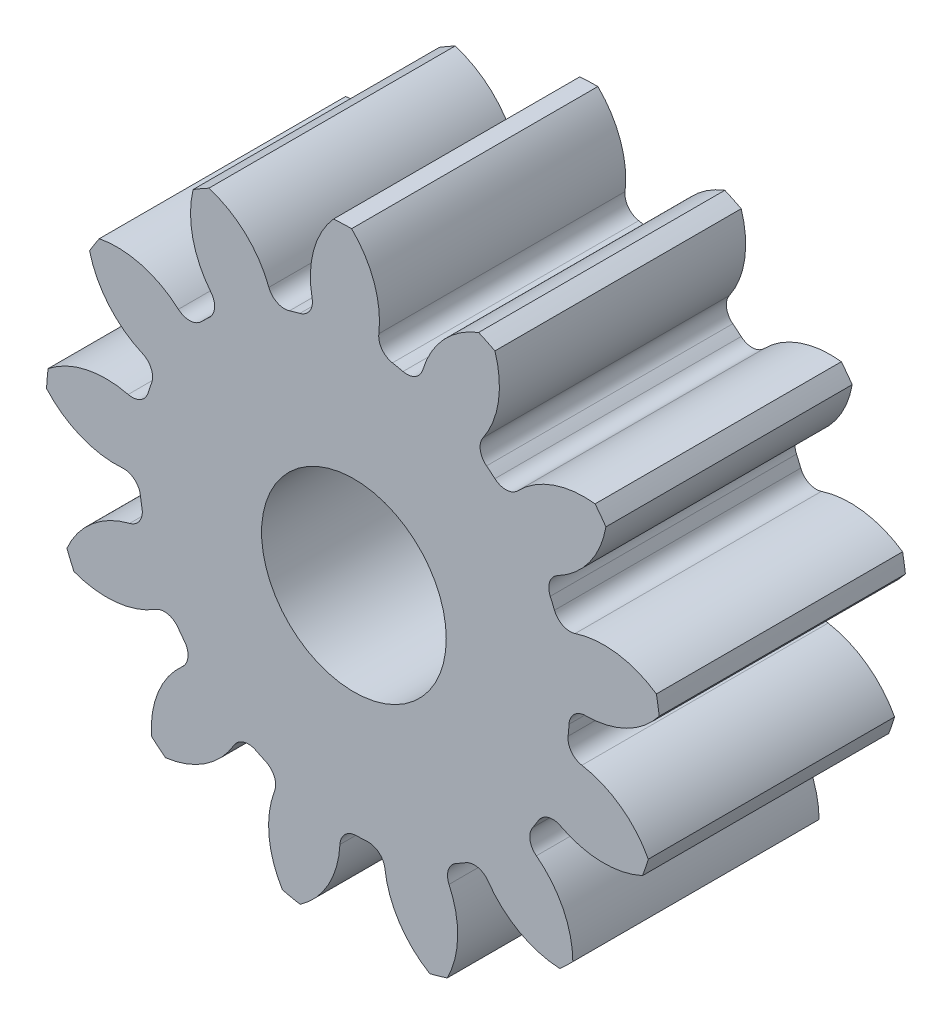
ISO-10303-21;
HEADER;
FILE_DESCRIPTION(('STEP AP214'),'2;1');
FILE_NAME('part.step','',(''),(''),'','','');
FILE_SCHEMA(('AUTOMOTIVE_DESIGN { 1 0 10303 214 1 1 1 1 }'));
ENDSEC;
DATA;
#1=APPLICATION_CONTEXT('core data for automotive mechanical design processes');
#2=APPLICATION_PROTOCOL_DEFINITION('international standard','automotive_design',2000,#1);
#3=PRODUCT_CONTEXT('',#1,'mechanical');
#4=PRODUCT('Part','Part','',(#3));
#5=PRODUCT_RELATED_PRODUCT_CATEGORY('part','',(#4));
#6=PRODUCT_DEFINITION_FORMATION('','',#4);
#7=PRODUCT_DEFINITION_CONTEXT('part definition',#1,'design');
#8=PRODUCT_DEFINITION('design','',#6,#7);
#9=PRODUCT_DEFINITION_SHAPE('','',#8);
#10=(LENGTH_UNIT() NAMED_UNIT(*) SI_UNIT(.MILLI.,.METRE.));
#11=(NAMED_UNIT(*) PLANE_ANGLE_UNIT() SI_UNIT($,.RADIAN.));
#12=(NAMED_UNIT(*) SI_UNIT($,.STERADIAN.) SOLID_ANGLE_UNIT());
#13=UNCERTAINTY_MEASURE_WITH_UNIT(LENGTH_MEASURE(1.E-05),#10,'distance_accuracy_value','');
#14=(GEOMETRIC_REPRESENTATION_CONTEXT(3) GLOBAL_UNCERTAINTY_ASSIGNED_CONTEXT((#13)) GLOBAL_UNIT_ASSIGNED_CONTEXT((#10,
#11,#12)) REPRESENTATION_CONTEXT('',''));
#15=CARTESIAN_POINT('',(0.,0.,0.));
#16=DIRECTION('',(0.,0.,1.));
#17=DIRECTION('',(1.,0.,0.));
#18=AXIS2_PLACEMENT_3D('',#15,#16,#17);
#19=CARTESIAN_POINT('',(0.,0.,101.6));
#20=DIRECTION('',(0.,0.,-1.));
#21=DIRECTION('',(-1.,0.,0.));
#22=AXIS2_PLACEMENT_3D('',#19,#20,#21);
#23=CYLINDRICAL_SURFACE('',#22,127.);
#24=DIRECTION('',(0.,0.,-1.));
#25=VECTOR('',#24,1.);
#26=CARTESIAN_POINT('',(124.78432877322,23.6192991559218,50.8));
#27=LINE('',#26,#25);
#28=CARTESIAN_POINT('',(124.78432877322,23.6192991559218,101.6));
#29=VERTEX_POINT('',#28);
#30=CARTESIAN_POINT('',(124.78432877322,23.6192991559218,0.));
#31=VERTEX_POINT('',#30);
#32=EDGE_CURVE('E564',#29,#31,#27,.T.);
#33=ORIENTED_EDGE('',*,*,#32,.F.);
#34=CARTESIAN_POINT('',(0.,0.,101.6));
#35=DIRECTION('',(0.,0.,1.));
#36=DIRECTION('',(1.,0.,0.));
#37=AXIS2_PLACEMENT_3D('',#34,#35,#36);
#38=CIRCLE('',#37,127.);
#39=CARTESIAN_POINT('',(125.956883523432,16.2438755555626,101.6));
#40=VERTEX_POINT('',#39);
#41=EDGE_CURVE('E1019',#40,#29,#38,.T.);
#42=ORIENTED_EDGE('',*,*,#41,.F.);
#43=DIRECTION('',(0.,0.,-1.));
#44=VECTOR('',#43,1.);
#45=CARTESIAN_POINT('',(125.956883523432,16.2438755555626,50.8));
#46=LINE('',#45,#44);
#47=CARTESIAN_POINT('',(125.956883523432,16.2438755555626,0.));
#48=VERTEX_POINT('',#47);
#49=EDGE_CURVE('E1013',#48,#40,#46,.F.);
#50=ORIENTED_EDGE('',*,*,#49,.F.);
#51=CARTESIAN_POINT('',(0.,0.,0.));
#52=DIRECTION('',(0.,0.,1.));
#53=DIRECTION('',(1.,0.,0.));
#54=AXIS2_PLACEMENT_3D('',#51,#52,#53);
#55=CIRCLE('',#54,127.);
#56=EDGE_CURVE('E1024',#48,#31,#55,.T.);
#57=ORIENTED_EDGE('',*,*,#56,.T.);
#58=EDGE_LOOP('',(#33,#42,#50,#57));
#59=FACE_BOUND('',#58,.T.);
#60=ADVANCED_FACE('F33',(#59),#23,.T.);
#61=DIRECTION('',(0.,0.,-1.));
#62=VECTOR('',#61,1.);
#63=CARTESIAN_POINT('',(103.980376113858,72.9183199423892,50.8));
#64=LINE('',#63,#62);
#65=CARTESIAN_POINT('',(103.980376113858,72.9183199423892,0.));
#66=VERTEX_POINT('',#65);
#67=CARTESIAN_POINT('',(103.980376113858,72.9183199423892,101.6));
#68=VERTEX_POINT('',#67);
#69=EDGE_CURVE('E535',#66,#68,#64,.F.);
#70=ORIENTED_EDGE('',*,*,#69,.F.);
#71=CARTESIAN_POINT('',(99.5146001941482,78.9040198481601,0.));
#72=VERTEX_POINT('',#71);
#73=EDGE_CURVE('E1027',#66,#72,#55,.T.);
#74=ORIENTED_EDGE('',*,*,#73,.T.);
#75=DIRECTION('',(0.,0.,-1.));
#76=VECTOR('',#75,1.);
#77=CARTESIAN_POINT('',(99.5146001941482,78.9040198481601,50.8));
#78=LINE('',#77,#76);
#79=CARTESIAN_POINT('',(99.5146001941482,78.9040198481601,101.6));
#80=VERTEX_POINT('',#79);
#81=EDGE_CURVE('E597',#80,#72,#78,.T.);
#82=ORIENTED_EDGE('',*,*,#81,.F.);
#83=EDGE_CURVE('E1022',#68,#80,#38,.T.);
#84=ORIENTED_EDGE('',*,*,#83,.F.);
#85=EDGE_LOOP('',(#70,#74,#82,#84));
#86=FACE_BOUND('',#85,.T.);
#87=ADVANCED_FACE('F1176',(#86),#23,.T.);
#88=CARTESIAN_POINT('',(0.,0.,101.6));
#89=DIRECTION('',(0.,0.,1.));
#90=DIRECTION('',(1.,0.,0.));
#91=AXIS2_PLACEMENT_3D('',#88,#89,#90);
#92=PLANE('',#91);
#93=CARTESIAN_POINT('',(0.,0.,101.599999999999));
#94=DIRECTION('',(0.,0.,1.));
#95=DIRECTION('',(1.,0.,0.));
#96=AXIS2_PLACEMENT_3D('',#93,#94,#95);
#97=CIRCLE('',#96,38.1);
#98=CARTESIAN_POINT('',(38.1,0.,101.599999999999));
#99=VERTEX_POINT('',#98);
#100=EDGE_CURVE('E552',#99,#99,#97,.T.);
#101=ORIENTED_EDGE('',*,*,#100,.F.);
#102=EDGE_LOOP('',(#101));
#103=FACE_BOUND('',#102,.T.);
#104=ORIENTED_EDGE('',*,*,#41,.T.);
#105=CARTESIAN_POINT('',(103.119377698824,-7.99485715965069,101.6));
#106=DIRECTION('',(0.,0.,-1.));
#107=DIRECTION('',(0.885456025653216,0.464723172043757,0.));
#108=AXIS2_PLACEMENT_3D('',#105,#106,#107);
#109=CIRCLE('',#108,38.3252525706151);
#110=CARTESIAN_POINT('',(91.2902924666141,28.4591923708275,101.6));
#111=VERTEX_POINT('',#110);
#112=EDGE_CURVE('E544',#111,#29,#109,.T.);
#113=ORIENTED_EDGE('',*,*,#112,.F.);
#114=CARTESIAN_POINT('',(89.1631185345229,35.0145685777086,101.6));
#115=DIRECTION('',(0.,0.,1.));
#116=DIRECTION('',(-0.885456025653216,-0.464723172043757,0.));
#117=AXIS2_PLACEMENT_3D('',#114,#115,#116);
#118=CIRCLE('',#117,6.89186666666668);
#119=CARTESIAN_POINT('',(82.7481655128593,32.4954012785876,101.6));
#120=VERTEX_POINT('',#119);
#121=EDGE_CURVE('E542',#120,#111,#118,.T.);
#122=ORIENTED_EDGE('',*,*,#121,.F.);
#123=CARTESIAN_POINT('',(0.,0.,101.6));
#124=DIRECTION('',(0.,0.,-1.));
#125=DIRECTION('',(0.885456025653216,0.464723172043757,0.));
#126=AXIS2_PLACEMENT_3D('',#123,#124,#125);
#127=CIRCLE('',#126,88.9);
#128=CARTESIAN_POINT('',(81.0116321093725,36.6104556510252,101.6));
#129=VERTEX_POINT('',#128);
#130=EDGE_CURVE('E527',#129,#120,#127,.T.);
#131=ORIENTED_EDGE('',*,*,#130,.F.);
#132=CARTESIAN_POINT('',(87.2919624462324,39.4486376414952,101.6));
#133=DIRECTION('',(0.,0.,1.));
#134=DIRECTION('',(-0.885456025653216,-0.464723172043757,0.));
#135=AXIS2_PLACEMENT_3D('',#132,#133,#134);
#136=CIRCLE('',#135,6.89186666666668);
#137=CARTESIAN_POINT('',(84.0796946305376,45.5461093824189,101.6));
#138=VERTEX_POINT('',#137);
#139=EDGE_CURVE('E519',#138,#129,#136,.T.);
#140=ORIENTED_EDGE('',*,*,#139,.F.);
#141=CARTESIAN_POINT('',(66.2164681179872,79.453779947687,101.6));
#142=DIRECTION('',(0.,0.,-1.));
#143=DIRECTION('',(-0.885456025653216,-0.464723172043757,0.));
#144=AXIS2_PLACEMENT_3D('',#141,#142,#143);
#145=CIRCLE('',#144,38.3252525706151);
#146=EDGE_CURVE('E549',#68,#138,#145,.T.);
#147=ORIENTED_EDGE('',*,*,#146,.F.);
#148=ORIENTED_EDGE('',*,*,#83,.T.);
#149=CARTESIAN_POINT('',(95.0230697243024,40.8428698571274,101.6));
#150=DIRECTION('',(0.,0.,-1.));
#151=DIRECTION('',(0.568064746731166,0.822983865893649,0.));
#152=AXIS2_PLACEMENT_3D('',#149,#150,#151);
#153=CIRCLE('',#152,38.3252525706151);
#154=CARTESIAN_POINT('',(67.6078933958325,67.6240776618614,101.6));
#155=VERTEX_POINT('',#154);
#156=EDGE_CURVE('E573',#155,#80,#153,.T.);
#157=ORIENTED_EDGE('',*,*,#156,.F.);
#158=CARTESIAN_POINT('',(62.6779391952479,72.4400280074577,101.6));
#159=DIRECTION('',(0.,0.,1.));
#160=DIRECTION('',(-0.568064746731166,-0.822983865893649,0.));
#161=AXIS2_PLACEMENT_3D('',#158,#159,#160);
#162=CIRCLE('',#161,6.89186666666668);
#163=CARTESIAN_POINT('',(58.1684958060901,67.2282388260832,101.6));
#164=VERTEX_POINT('',#163);
#165=EDGE_CURVE('E571',#164,#155,#162,.T.);
#166=ORIENTED_EDGE('',*,*,#165,.F.);
#167=CARTESIAN_POINT('',(0.,0.,101.6));
#168=DIRECTION('',(0.,0.,-1.));
#169=DIRECTION('',(0.568064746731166,0.822983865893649,0.));
#170=AXIS2_PLACEMENT_3D('',#167,#168,#169);
#171=CIRCLE('',#170,88.9);
#172=CARTESIAN_POINT('',(54.7185107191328,70.0649312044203,101.6));
#173=VERTEX_POINT('',#172);
#174=EDGE_CURVE('E568',#173,#164,#171,.T.);
#175=ORIENTED_EDGE('',*,*,#174,.F.);
#176=CARTESIAN_POINT('',(58.9604981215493,75.4966315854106,101.6));
#177=DIRECTION('',(0.,0.,1.));
#178=DIRECTION('',(-0.568064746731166,-0.822983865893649,0.));
#179=AXIS2_PLACEMENT_3D('',#176,#177,#178);
#180=CIRCLE('',#179,6.89186666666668);
#181=CARTESIAN_POINT('',(53.2825398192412,79.4028593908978,101.6));
#182=VERTEX_POINT('',#181);
#183=EDGE_CURVE('E566',#182,#173,#180,.T.);
#184=ORIENTED_EDGE('',*,*,#183,.F.);
#185=CARTESIAN_POINT('',(21.7077580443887,101.12515532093,101.6));
#186=DIRECTION('',(0.,0.,-1.));
#187=DIRECTION('',(-0.568064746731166,-0.822983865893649,0.));
#188=AXIS2_PLACEMENT_3D('',#185,#186,#187);
#189=CIRCLE('',#188,38.3252525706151);
#190=CARTESIAN_POINT('',(58.183217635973,112.888055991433,101.6));
#191=VERTEX_POINT('',#190);
#192=EDGE_CURVE('E576',#191,#182,#189,.T.);
#193=ORIENTED_EDGE('',*,*,#192,.F.);
#194=CARTESIAN_POINT('',(51.447275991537,116.112780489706,101.6));
#195=VERTEX_POINT('',#194);
#196=EDGE_CURVE('E1061',#191,#195,#38,.T.);
#197=ORIENTED_EDGE('',*,*,#196,.T.);
#198=CARTESIAN_POINT('',(65.1581216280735,80.3239875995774,101.6));
#199=DIRECTION('',(0.,0.,-1.));
#200=DIRECTION('',(0.120536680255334,0.992708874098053,0.));
#201=AXIS2_PLACEMENT_3D('',#198,#199,#200);
#202=CIRCLE('',#201,38.3252525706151);
#203=CARTESIAN_POINT('',(28.4373407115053,91.2971017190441,101.6));
#204=VERTEX_POINT('',#203);
#205=EDGE_CURVE('E608',#204,#195,#202,.T.);
#206=ORIENTED_EDGE('',*,*,#205,.F.);
#207=CARTESIAN_POINT('',(21.8339993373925,93.2703500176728,101.6));
#208=DIRECTION('',(0.,0.,1.));
#209=DIRECTION('',(-0.120536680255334,-0.992708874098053,0.));
#210=AXIS2_PLACEMENT_3D('',#207,#208,#209);
#211=CIRCLE('',#210,6.89186666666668);
#212=CARTESIAN_POINT('',(20.2631247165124,86.5598970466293,101.6));
#213=VERTEX_POINT('',#212);
#214=EDGE_CURVE('E606',#213,#204,#211,.T.);
#215=ORIENTED_EDGE('',*,*,#214,.F.);
#216=CARTESIAN_POINT('',(0.,0.,101.6));
#217=DIRECTION('',(0.,0.,-1.));
#218=DIRECTION('',(0.120536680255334,0.992708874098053,0.));
#219=AXIS2_PLACEMENT_3D('',#216,#217,#218);
#220=CIRCLE('',#219,88.9);
#221=CARTESIAN_POINT('',(15.8900379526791,87.4683753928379,101.6));
#222=VERTEX_POINT('',#221);
#223=EDGE_CURVE('E603',#222,#213,#220,.T.);
#224=ORIENTED_EDGE('',*,*,#223,.F.);
#225=CARTESIAN_POINT('',(17.1218942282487,94.2492570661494,101.6));
#226=DIRECTION('',(0.,0.,1.));
#227=DIRECTION('',(-0.120536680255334,-0.992708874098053,0.));
#228=AXIS2_PLACEMENT_3D('',#225,#226,#227);
#229=CIRCLE('',#228,6.89186666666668);
#230=CARTESIAN_POINT('',(10.2789972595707,95.0693712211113,101.6));
#231=VERTEX_POINT('',#230);
#232=EDGE_CURVE('E601',#231,#222,#229,.T.);
#233=ORIENTED_EDGE('',*,*,#232,.F.);
#234=CARTESIAN_POINT('',(-27.7739377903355,99.6299763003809,101.6));
#235=DIRECTION('',(0.,0.,-1.));
#236=DIRECTION('',(-0.120536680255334,-0.992708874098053,0.));
#237=AXIS2_PLACEMENT_3D('',#234,#235,#236);
#238=CIRCLE('',#237,38.3252525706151);
#239=CARTESIAN_POINT('',(-0.94301481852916,126.996498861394,101.6));
#240=VERTEX_POINT('',#239);
#241=EDGE_CURVE('E611',#240,#231,#238,.T.);
#242=ORIENTED_EDGE('',*,*,#241,.F.);
#243=CARTESIAN_POINT('',(-8.40599913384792,126.721502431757,101.6));
#244=VERTEX_POINT('',#243);
#245=EDGE_CURVE('E1158',#240,#244,#38,.T.);
#246=ORIENTED_EDGE('',*,*,#245,.T.);
#247=CARTESIAN_POINT('',(20.3662331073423,101.403847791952,101.6));
#248=DIRECTION('',(0.,0.,-1.));
#249=DIRECTION('',(-0.354604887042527,0.935016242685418,0.));
#250=AXIS2_PLACEMENT_3D('',#247,#248,#249);
#251=CIRCLE('',#250,38.3252525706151);
#252=CARTESIAN_POINT('',(-17.2478640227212,94.0550600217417,101.6));
#253=VERTEX_POINT('',#252);
#254=EDGE_CURVE('E646',#253,#244,#251,.T.);
#255=ORIENTED_EDGE('',*,*,#254,.F.);
#256=CARTESIAN_POINT('',(-24.0118466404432,92.7335588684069,101.6));
#257=DIRECTION('',(0.,0.,1.));
#258=DIRECTION('',(0.354604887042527,-0.935016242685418,0.));
#259=AXIS2_PLACEMENT_3D('',#256,#257,#258);
#260=CIRCLE('',#259,6.89186666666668);
#261=CARTESIAN_POINT('',(-22.2842840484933,86.0617260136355,101.6));
#262=VERTEX_POINT('',#261);
#263=EDGE_CURVE('E644',#262,#253,#260,.T.);
#264=ORIENTED_EDGE('',*,*,#263,.F.);
#265=CARTESIAN_POINT('',(0.,0.,101.6));
#266=DIRECTION('',(0.,0.,-1.));
#267=DIRECTION('',(-0.354604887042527,0.935016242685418,0.));
#268=AXIS2_PLACEMENT_3D('',#265,#266,#267);
#269=CIRCLE('',#268,88.9);
#270=CARTESIAN_POINT('',(-26.578651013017,84.8338688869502,101.6));
#271=VERTEX_POINT('',#270);
#272=EDGE_CURVE('E641',#271,#262,#269,.T.);
#273=ORIENTED_EDGE('',*,*,#272,.F.);
#274=CARTESIAN_POINT('',(-28.6391292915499,91.4105135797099,101.6));
#275=DIRECTION('',(0.,0.,1.));
#276=DIRECTION('',(0.354604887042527,-0.935016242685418,0.));
#277=AXIS2_PLACEMENT_3D('',#274,#275,#276);
#278=CIRCLE('',#277,6.89186666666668);
#279=CARTESIAN_POINT('',(-35.0793396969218,88.9566358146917,101.6));
#280=VERTEX_POINT('',#279);
#281=EDGE_CURVE('E639',#280,#271,#278,.T.);
#282=ORIENTED_EDGE('',*,*,#281,.F.);
#283=CARTESIAN_POINT('',(-70.8929591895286,75.3107703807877,101.6));
#284=DIRECTION('',(0.,0.,-1.));
#285=DIRECTION('',(0.354604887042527,-0.935016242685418,0.));
#286=AXIS2_PLACEMENT_3D('',#283,#284,#285);
#287=CIRCLE('',#286,38.3252525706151);
#288=CARTESIAN_POINT('',(-59.8532139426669,112.011574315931,101.6));
#289=VERTEX_POINT('',#288);
#290=EDGE_CURVE('E649',#289,#280,#287,.T.);
#291=ORIENTED_EDGE('',*,*,#290,.F.);
#292=CARTESIAN_POINT('',(-66.3335611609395,108.299855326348,101.6));
#293=VERTEX_POINT('',#292);
#294=EDGE_CURVE('E1154',#289,#293,#38,.T.);
#295=ORIENTED_EDGE('',*,*,#294,.T.);
#296=CARTESIAN_POINT('',(-29.0913139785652,99.2533085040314,101.6));
#297=DIRECTION('',(0.,0.,-1.));
#298=DIRECTION('',(-0.748510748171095,0.663122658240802,0.));
#299=AXIS2_PLACEMENT_3D('',#296,#297,#298);
#300=CIRCLE('',#299,38.3252525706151);
#301=CARTESIAN_POINT('',(-58.9817909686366,75.2661375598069,101.6));
#302=VERTEX_POINT('',#301);
#303=EDGE_CURVE('E684',#302,#293,#300,.T.);
#304=ORIENTED_EDGE('',*,*,#303,.F.);
#305=CARTESIAN_POINT('',(-64.3568679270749,70.9526269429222,101.6));
#306=DIRECTION('',(0.,0.,1.));
#307=DIRECTION('',(0.748510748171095,-0.663122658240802,0.));
#308=AXIS2_PLACEMENT_3D('',#305,#306,#307);
#309=CIRCLE('',#308,6.89186666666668);
#310=CARTESIAN_POINT('',(-59.7266318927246,65.8478507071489,101.6));
#311=VERTEX_POINT('',#310);
#312=EDGE_CURVE('E682',#311,#302,#309,.T.);
#313=ORIENTED_EDGE('',*,*,#312,.F.);
#314=CARTESIAN_POINT('',(0.,0.,101.6));
#315=DIRECTION('',(0.,0.,-1.));
#316=DIRECTION('',(-0.748510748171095,0.663122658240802,0.));
#317=AXIS2_PLACEMENT_3D('',#314,#315,#316);
#318=CIRCLE('',#317,88.9);
#319=CARTESIAN_POINT('',(-62.9584913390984,62.7649453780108,101.6));
#320=VERTEX_POINT('',#319);
#321=EDGE_CURVE('E679',#320,#311,#318,.T.);
#322=ORIENTED_EDGE('',*,*,#321,.F.);
#323=CARTESIAN_POINT('',(-67.8392734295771,67.630723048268,101.6));
#324=DIRECTION('',(0.,0.,1.));
#325=DIRECTION('',(0.748510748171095,-0.663122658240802,0.));
#326=AXIS2_PLACEMENT_3D('',#323,#324,#325);
#327=CIRCLE('',#326,6.89186666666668);
#328=CARTESIAN_POINT('',(-72.4014226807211,62.4650071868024,101.6));
#329=VERTEX_POINT('',#328);
#330=EDGE_CURVE('E677',#329,#320,#327,.T.);
#331=ORIENTED_EDGE('',*,*,#330,.F.);
#332=CARTESIAN_POINT('',(-97.7712579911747,33.7387745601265,101.6));
#333=DIRECTION('',(0.,0.,-1.));
#334=DIRECTION('',(0.748510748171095,-0.663122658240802,0.));
#335=AXIS2_PLACEMENT_3D('',#332,#333,#334);
#336=CIRCLE('',#335,38.3252525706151);
#337=CARTESIAN_POINT('',(-105.051763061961,71.3661479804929,101.6));
#338=VERTEX_POINT('',#337);
#339=EDGE_CURVE('E687',#338,#329,#336,.T.);
#340=ORIENTED_EDGE('',*,*,#339,.F.);
#341=CARTESIAN_POINT('',(-109.064903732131,65.0680165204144,101.6));
#342=VERTEX_POINT('',#341);
#343=EDGE_CURVE('E1150',#338,#342,#38,.T.);
#344=ORIENTED_EDGE('',*,*,#343,.T.);
#345=CARTESIAN_POINT('',(-71.8843916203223,74.3650323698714,101.6));
#346=DIRECTION('',(0.,0.,-1.));
#347=DIRECTION('',(-0.97094181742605,0.239315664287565,0.));
#348=AXIS2_PLACEMENT_3D('',#345,#346,#347);
#349=CIRCLE('',#348,38.3252525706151);
#350=CARTESIAN_POINT('',(-87.2037004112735,39.234650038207,101.6));
#351=VERTEX_POINT('',#350);
#352=EDGE_CURVE('E722',#351,#342,#349,.T.);
#353=ORIENTED_EDGE('',*,*,#352,.F.);
#354=CARTESIAN_POINT('',(-89.9585063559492,32.9173032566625,101.6));
#355=DIRECTION('',(0.,0.,1.));
#356=DIRECTION('',(0.97094181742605,-0.239315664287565,0.));
#357=AXIS2_PLACEMENT_3D('',#354,#355,#356);
#358=CIRCLE('',#357,6.89186666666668);
#359=CARTESIAN_POINT('',(-83.486328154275,30.5490263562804,101.6));
#360=VERTEX_POINT('',#359);
#361=EDGE_CURVE('E720',#360,#351,#358,.T.);
#362=ORIENTED_EDGE('',*,*,#361,.F.);
#363=CARTESIAN_POINT('',(0.,0.,101.6));
#364=DIRECTION('',(0.,0.,-1.));
#365=DIRECTION('',(-0.97094181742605,0.239315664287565,0.));
#366=AXIS2_PLACEMENT_3D('',#363,#364,#365);
#367=CIRCLE('',#366,88.9);
#368=CARTESIAN_POINT('',(-84.9153000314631,26.3173292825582,101.6));
#369=VERTEX_POINT('',#368);
#370=EDGE_CURVE('E717',#369,#360,#367,.T.);
#371=ORIENTED_EDGE('',*,*,#370,.F.);
#372=CARTESIAN_POINT('',(-91.4982575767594,28.3575489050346,101.6));
#373=DIRECTION('',(0.,0.,1.));
#374=DIRECTION('',(0.97094181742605,-0.239315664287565,0.));
#375=AXIS2_PLACEMENT_3D('',#372,#373,#374);
#376=CIRCLE('',#375,6.89186666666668);
#377=CARTESIAN_POINT('',(-93.1372122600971,21.6633981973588,101.6));
#378=VERTEX_POINT('',#377);
#379=EDGE_CURVE('E715',#378,#369,#376,.T.);
#380=ORIENTED_EDGE('',*,*,#379,.F.);
#381=CARTESIAN_POINT('',(-102.251339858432,-15.5623679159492,101.6));
#382=DIRECTION('',(0.,0.,-1.));
#383=DIRECTION('',(0.97094181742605,-0.239315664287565,0.));
#384=AXIS2_PLACEMENT_3D('',#381,#382,#383);
#385=CIRCLE('',#384,38.3252525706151);
#386=CARTESIAN_POINT('',(-126.184219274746,14.3715971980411,101.6));
#387=VERTEX_POINT('',#386);
#388=EDGE_CURVE('E725',#387,#378,#385,.T.);
#389=ORIENTED_EDGE('',*,*,#388,.F.);
#390=CARTESIAN_POINT('',(-126.810791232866,6.92987928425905,101.6));
#391=VERTEX_POINT('',#390);
#392=EDGE_CURVE('E1146',#387,#391,#38,.T.);
#393=ORIENTED_EDGE('',*,*,#392,.T.);
#394=CARTESIAN_POINT('',(-98.2096214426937,32.4406235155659,101.6));
#395=DIRECTION('',(0.,0.,-1.));
#396=DIRECTION('',(-0.970941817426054,-0.239315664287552,0.));
#397=AXIS2_PLACEMENT_3D('',#394,#395,#396);
#398=CIRCLE('',#397,38.3252525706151);
#399=CARTESIAN_POINT('',(-95.4482930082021,-5.78502297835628,101.6));
#400=VERTEX_POINT('',#399);
#401=EDGE_CURVE('E760',#400,#391,#398,.T.);
#402=ORIENTED_EDGE('',*,*,#401,.F.);
#403=CARTESIAN_POINT('',(-94.9517350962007,-12.6589779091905,101.6));
#404=DIRECTION('',(0.,0.,1.));
#405=DIRECTION('',(0.970941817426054,0.239315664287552,0.));
#406=AXIS2_PLACEMENT_3D('',#403,#404,#405);
#407=CIRCLE('',#406,6.89186666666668);
#408=CARTESIAN_POINT('',(-88.1203127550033,-11.7482117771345,101.6));
#409=VERTEX_POINT('',#408);
#410=EDGE_CURVE('E758',#409,#400,#407,.T.);
#411=ORIENTED_EDGE('',*,*,#410,.F.);
#412=CARTESIAN_POINT('',(0.,0.,101.6));
#413=DIRECTION('',(0.,0.,-1.));
#414=DIRECTION('',(-0.970941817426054,-0.239315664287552,0.));
#415=AXIS2_PLACEMENT_3D('',#412,#413,#414);
#416=CIRCLE('',#415,88.9);
#417=CARTESIAN_POINT('',(-87.41903682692,-16.1592697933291,101.6));
#418=VERTEX_POINT('',#417);
#419=EDGE_CURVE('E755',#418,#409,#416,.T.);
#420=ORIENTED_EDGE('',*,*,#419,.F.);
#421=CARTESIAN_POINT('',(-94.1960935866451,-17.4119979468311,101.6));
#422=DIRECTION('',(0.,0.,1.));
#423=DIRECTION('',(0.970941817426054,0.239315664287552,0.));
#424=AXIS2_PLACEMENT_3D('',#421,#422,#423);
#425=CIRCLE('',#424,6.89186666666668);
#426=CARTESIAN_POINT('',(-92.5363889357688,-24.10103424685,101.6));
#427=VERTEX_POINT('',#426);
#428=EDGE_CURVE('E753',#427,#418,#425,.T.);
#429=ORIENTED_EDGE('',*,*,#428,.F.);
#430=CARTESIAN_POINT('',(-83.3068720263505,-61.2983594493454,101.6));
#431=DIRECTION('',(0.,0.,-1.));
#432=DIRECTION('',(0.970941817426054,0.239315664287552,0.));
#433=AXIS2_PLACEMENT_3D('',#430,#431,#432);
#434=CIRCLE('',#433,38.3252525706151);
#435=CARTESIAN_POINT('',(-118.409391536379,-45.9153133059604,101.6));
#436=VERTEX_POINT('',#435);
#437=EDGE_CURVE('E763',#436,#427,#434,.T.);
#438=ORIENTED_EDGE('',*,*,#437,.F.);
#439=CARTESIAN_POINT('',(-115.505854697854,-52.7958097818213,101.6));
#440=VERTEX_POINT('',#439);
#441=EDGE_CURVE('E1142',#436,#440,#38,.T.);
#442=ORIENTED_EDGE('',*,*,#441,.T.);
#443=CARTESIAN_POINT('',(-102.036210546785,-16.9155412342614,101.6));
#444=DIRECTION('',(0.,0.,-1.));
#445=DIRECTION('',(-0.748510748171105,-0.663122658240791,0.));
#446=AXIS2_PLACEMENT_3D('',#443,#444,#445);
#447=CIRCLE('',#446,38.3252525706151);
#448=CARTESIAN_POINT('',(-81.8268319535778,-49.4794169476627,101.6));
#449=VERTEX_POINT('',#448);
#450=EDGE_CURVE('E798',#449,#440,#447,.T.);
#451=ORIENTED_EDGE('',*,*,#450,.F.);
#452=CARTESIAN_POINT('',(-78.1926656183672,-55.3352397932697,101.6));
#453=DIRECTION('',(0.,0.,1.));
#454=DIRECTION('',(0.748510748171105,0.663122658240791,0.));
#455=AXIS2_PLACEMENT_3D('',#452,#453,#454);
#456=CIRCLE('',#455,6.89186666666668);
#457=CARTESIAN_POINT('',(-72.5669956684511,-51.3540761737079,101.6));
#458=VERTEX_POINT('',#457);
#459=EDGE_CURVE('E796',#458,#449,#456,.T.);
#460=ORIENTED_EDGE('',*,*,#459,.F.);
#461=CARTESIAN_POINT('',(0.,0.,101.6));
#462=DIRECTION('',(0.,0.,-1.));
#463=DIRECTION('',(-0.748510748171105,-0.663122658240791,0.));
#464=AXIS2_PLACEMENT_3D('',#461,#462,#463);
#465=CIRCLE('',#464,88.9);
#466=CARTESIAN_POINT('',(-69.8961257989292,-54.9339748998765,101.6));
#467=VERTEX_POINT('',#466);
#468=EDGE_CURVE('E793',#467,#458,#465,.T.);
#469=ORIENTED_EDGE('',*,*,#468,.F.);
#470=CARTESIAN_POINT('',(-75.3147397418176,-59.1926659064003,101.6));
#471=DIRECTION('',(0.,0.,1.));
#472=DIRECTION('',(0.748510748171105,0.663122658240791,0.));
#473=AXIS2_PLACEMENT_3D('',#470,#471,#472);
#474=CIRCLE('',#473,6.89186666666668);
#475=CARTESIAN_POINT('',(-70.7365940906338,-64.3442101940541,101.6));
#476=VERTEX_POINT('',#475);
#477=EDGE_CURVE('E791',#476,#467,#474,.T.);
#478=ORIENTED_EDGE('',*,*,#477,.F.);
#479=CARTESIAN_POINT('',(-45.2778037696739,-92.9916355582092,101.6));
#480=DIRECTION('',(0.,0.,-1.));
#481=DIRECTION('',(0.748510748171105,0.663122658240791,0.));
#482=AXIS2_PLACEMENT_3D('',#479,#480,#481);
#483=CIRCLE('',#482,38.3252525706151);
#484=CARTESIAN_POINT('',(-83.5083991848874,-95.6835788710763,101.6));
#485=VERTEX_POINT('',#484);
#486=EDGE_CURVE('E801',#485,#476,#483,.T.);
#487=ORIENTED_EDGE('',*,*,#486,.F.);
#488=CARTESIAN_POINT('',(-77.7399188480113,-100.426615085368,101.6));
#489=VERTEX_POINT('',#488);
#490=EDGE_CURVE('E1138',#485,#489,#38,.T.);
#491=ORIENTED_EDGE('',*,*,#490,.T.);
#492=CARTESIAN_POINT('',(-82.4875334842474,-62.39655934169,101.6));
#493=DIRECTION('',(0.,0.,-1.));
#494=DIRECTION('',(-0.35460488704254,-0.935016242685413,0.));
#495=AXIS2_PLACEMENT_3D('',#492,#493,#494);
#496=CIRCLE('',#495,38.3252525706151);
#497=CARTESIAN_POINT('',(-49.459829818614,-81.8386727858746,101.6));
#498=VERTEX_POINT('',#497);
#499=EDGE_CURVE('E836',#498,#489,#496,.T.);
#500=ORIENTED_EDGE('',*,*,#499,.F.);
#501=CARTESIAN_POINT('',(-43.5205987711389,-85.3348651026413,101.6));
#502=DIRECTION('',(0.,0.,1.));
#503=DIRECTION('',(0.35460488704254,0.935016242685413,0.));
#504=AXIS2_PLACEMENT_3D('',#501,#502,#503);
#505=CIRCLE('',#504,6.89186666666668);
#506=CARTESIAN_POINT('',(-40.3894544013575,-79.1953406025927,101.6));
#507=VERTEX_POINT('',#506);
#508=EDGE_CURVE('E834',#507,#498,#505,.T.);
#509=ORIENTED_EDGE('',*,*,#508,.F.);
#510=CARTESIAN_POINT('',(0.,0.,101.6));
#511=DIRECTION('',(0.,0.,-1.));
#512=DIRECTION('',(-0.35460488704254,-0.935016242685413,0.));
#513=AXIS2_PLACEMENT_3D('',#510,#511,#512);
#514=CIRCLE('',#513,88.9);
#515=CARTESIAN_POINT('',(-36.3608546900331,-81.1239683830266,101.6));
#516=VERTEX_POINT('',#515);
#517=EDGE_CURVE('E831',#516,#507,#514,.T.);
#518=ORIENTED_EDGE('',*,*,#517,.F.);
#519=CARTESIAN_POINT('',(-39.1796866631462,-87.4130074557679,101.6));
#520=DIRECTION('',(0.,0.,1.));
#521=DIRECTION('',(0.35460488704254,0.935016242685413,0.));
#522=AXIS2_PLACEMENT_3D('',#519,#520,#521);
#523=CIRCLE('',#522,6.89186666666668);
#524=CARTESIAN_POINT('',(-32.731898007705,-89.8469030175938,101.6));
#525=VERTEX_POINT('',#524);
#526=EDGE_CURVE('E829',#525,#516,#523,.T.);
#527=ORIENTED_EDGE('',*,*,#526,.F.);
#528=CARTESIAN_POINT('',(3.12386367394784,-103.381648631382,101.6));
#529=DIRECTION('',(0.,0.,-1.));
#530=DIRECTION('',(0.35460488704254,0.935016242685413,0.));
#531=AXIS2_PLACEMENT_3D('',#528,#529,#530);
#532=CIRCLE('',#531,38.3252525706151);
#533=CARTESIAN_POINT('',(-29.4766389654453,-123.531889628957,101.6));
#534=VERTEX_POINT('',#533);
#535=EDGE_CURVE('E839',#534,#525,#532,.T.);
#536=ORIENTED_EDGE('',*,*,#535,.F.);
#537=CARTESIAN_POINT('',(-22.1647044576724,-125.050893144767,101.6));
#538=VERTEX_POINT('',#537);
#539=EDGE_CURVE('E1134',#534,#538,#38,.T.);
#540=ORIENTED_EDGE('',*,*,#539,.T.);
#541=CARTESIAN_POINT('',(-44.0419565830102,-93.5832776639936,101.6));
#542=DIRECTION('',(0.,0.,-1.));
#543=DIRECTION('',(0.12053668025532,-0.992708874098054,0.));
#544=AXIS2_PLACEMENT_3D('',#541,#542,#543);
#545=CIRCLE('',#544,38.3252525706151);
#546=CARTESIAN_POINT('',(-5.7621767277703,-95.4496749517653,101.6));
#547=VERTEX_POINT('',#546);
#548=EDGE_CURVE('E874',#547,#538,#545,.T.);
#549=ORIENTED_EDGE('',*,*,#548,.F.);
#550=CARTESIAN_POINT('',(1.12151277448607,-95.7853012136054,101.6));
#551=DIRECTION('',(0.,0.,1.));
#552=DIRECTION('',(-0.12053668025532,0.992708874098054,0.));
#553=AXIS2_PLACEMENT_3D('',#550,#551,#552);
#554=CIRCLE('',#553,6.89186666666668);
#555=CARTESIAN_POINT('',(1.0408241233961,-88.89390690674,101.6));
#556=VERTEX_POINT('',#555);
#557=EDGE_CURVE('E872',#556,#547,#554,.T.);
#558=ORIENTED_EDGE('',*,*,#557,.F.);
#559=CARTESIAN_POINT('',(0.,0.,101.6));
#560=DIRECTION('',(0.,0.,-1.));
#561=DIRECTION('',(0.12053668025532,-0.992708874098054,0.));
#562=AXIS2_PLACEMENT_3D('',#559,#560,#561);
#563=CIRCLE('',#562,88.9);
#564=CARTESIAN_POINT('',(5.50425003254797,-88.7294383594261,101.6));
#565=VERTEX_POINT('',#564);
#566=EDGE_CURVE('E869',#565,#556,#563,.T.);
#567=ORIENTED_EDGE('',*,*,#566,.F.);
#568=CARTESIAN_POINT('',(5.93096046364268,-95.6080824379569,101.6));
#569=DIRECTION('',(0.,0.,1.));
#570=DIRECTION('',(-0.12053668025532,0.992708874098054,0.));
#571=AXIS2_PLACEMENT_3D('',#568,#569,#570);
#572=CIRCLE('',#571,6.89186666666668);
#573=CARTESIAN_POINT('',(12.7712814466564,-94.7667531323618,101.6));
#574=VERTEX_POINT('',#573);
#575=EDGE_CURVE('E867',#574,#565,#572,.T.);
#576=ORIENTED_EDGE('',*,*,#575,.F.);
#577=CARTESIAN_POINT('',(50.8098915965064,-90.0881718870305,101.6));
#578=DIRECTION('',(0.,0.,-1.));
#579=DIRECTION('',(-0.12053668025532,0.992708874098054,0.));
#580=AXIS2_PLACEMENT_3D('',#577,#578,#579);
#581=CIRCLE('',#580,38.3252525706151);
#582=CARTESIAN_POINT('',(31.307864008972,-123.080533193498,101.6));
#583=VERTEX_POINT('',#582);
#584=EDGE_CURVE('E877',#583,#574,#581,.T.);
#585=ORIENTED_EDGE('',*,*,#584,.F.);
#586=CARTESIAN_POINT('',(38.4881766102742,-121.027518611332,101.6));
#587=VERTEX_POINT('',#586);
#588=EDGE_CURVE('E1130',#583,#587,#38,.T.);
#589=ORIENTED_EDGE('',*,*,#588,.T.);
#590=CARTESIAN_POINT('',(4.4931018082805,-103.331194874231,101.6));
#591=DIRECTION('',(0.,0.,-1.));
#592=DIRECTION('',(0.568064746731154,-0.822983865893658,0.));
#593=AXIS2_PLACEMENT_3D('',#590,#591,#592);
#594=CIRCLE('',#593,38.3252525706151);
#595=CARTESIAN_POINT('',(39.2555216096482,-87.194306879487,101.6));
#596=VERTEX_POINT('',#595);
#597=EDGE_CURVE('E912',#596,#587,#594,.T.);
#598=ORIENTED_EDGE('',*,*,#597,.F.);
#599=CARTESIAN_POINT('',(45.5066992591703,-84.2924791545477,101.6));
#600=DIRECTION('',(0.,0.,1.));
#601=DIRECTION('',(-0.568064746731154,0.822983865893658,0.));
#602=AXIS2_PLACEMENT_3D('',#599,#600,#601);
#603=CIRCLE('',#602,6.89186666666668);
#604=CARTESIAN_POINT('',(42.23266238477,-78.227950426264,101.6));
#605=VERTEX_POINT('',#604);
#606=EDGE_CURVE('E910',#605,#596,#603,.T.);
#607=ORIENTED_EDGE('',*,*,#606,.F.);
#608=CARTESIAN_POINT('',(0.,0.,101.6));
#609=DIRECTION('',(0.,0.,-1.));
#610=DIRECTION('',(0.568064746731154,-0.822983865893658,0.));
#611=AXIS2_PLACEMENT_3D('',#608,#609,#610);
#612=CIRCLE('',#611,88.9);
#613=CARTESIAN_POINT('',(46.1083974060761,-76.0080633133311,101.6));
#614=VERTEX_POINT('',#613);
#615=EDGE_CURVE('E907',#614,#605,#612,.T.);
#616=ORIENTED_EDGE('',*,*,#615,.F.);
#617=CARTESIAN_POINT('',(49.6828960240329,-81.9004979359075,101.6));
#618=DIRECTION('',(0.,0.,1.));
#619=DIRECTION('',(-0.568064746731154,0.822983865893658,0.));
#620=AXIS2_PLACEMENT_3D('',#617,#618,#619);
#621=CIRCLE('',#620,6.89186666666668);
#622=CARTESIAN_POINT('',(55.348714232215,-77.976682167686,101.6));
#623=VERTEX_POINT('',#622);
#624=EDGE_CURVE('E905',#623,#614,#621,.T.);
#625=ORIENTED_EDGE('',*,*,#624,.F.);
#626=CARTESIAN_POINT('',(86.8559856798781,-56.1565806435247,101.6));
#627=DIRECTION('',(0.,0.,-1.));
#628=DIRECTION('',(-0.568064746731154,0.822983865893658,0.));
#629=AXIS2_PLACEMENT_3D('',#626,#627,#628);
#630=CIRCLE('',#629,38.3252525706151);
#631=CARTESIAN_POINT('',(84.9201126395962,-94.4329098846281,101.6));
#632=VERTEX_POINT('',#631);
#633=EDGE_CURVE('E915',#632,#623,#630,.T.);
#634=ORIENTED_EDGE('',*,*,#633,.F.);
#635=CARTESIAN_POINT('',(90.3238802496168,-89.2781981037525,101.6));
#636=VERTEX_POINT('',#635);
#637=EDGE_CURVE('E1129',#632,#636,#38,.T.);
#638=ORIENTED_EDGE('',*,*,#637,.T.);
#639=CARTESIAN_POINT('',(51.9988447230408,-89.4071806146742,101.6));
#640=DIRECTION('',(0.,0.,-1.));
#641=DIRECTION('',(0.885456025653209,-0.46472317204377,0.));
#642=AXIS2_PLACEMENT_3D('',#639,#640,#641);
#643=CIRCLE('',#642,38.3252525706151);
#644=CARTESIAN_POINT('',(75.2802530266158,-58.9637739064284,101.6));
#645=VERTEX_POINT('',#644);
#646=EDGE_CURVE('E950',#645,#636,#643,.T.);
#647=ORIENTED_EDGE('',*,*,#646,.F.);
#648=CARTESIAN_POINT('',(79.4668493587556,-53.4892659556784,101.6));
#649=DIRECTION('',(0.,0.,1.));
#650=DIRECTION('',(-0.885456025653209,0.46472317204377,0.));
#651=AXIS2_PLACEMENT_3D('',#648,#649,#650);
#652=CIRCLE('',#651,6.89186666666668);
#653=CARTESIAN_POINT('',(73.7495066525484,-49.6409132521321,101.6));
#654=VERTEX_POINT('',#653);
#655=EDGE_CURVE('E948',#654,#645,#652,.T.);
#656=ORIENTED_EDGE('',*,*,#655,.F.);
#657=CARTESIAN_POINT('',(0.,0.,101.6));
#658=DIRECTION('',(0.,0.,-1.));
#659=DIRECTION('',(0.885456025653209,-0.46472317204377,0.));
#660=AXIS2_PLACEMENT_3D('',#657,#658,#659);
#661=CIRCLE('',#660,88.9);
#662=CARTESIAN_POINT('',(76.1496666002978,-45.8741569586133,101.6));
#663=VERTEX_POINT('',#662);
#664=EDGE_CURVE('E945',#663,#654,#661,.T.);
#665=ORIENTED_EDGE('',*,*,#664,.F.);
#666=CARTESIAN_POINT('',(82.0530788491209,-49.4304963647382,101.6));
#667=DIRECTION('',(0.,0.,1.));
#668=DIRECTION('',(-0.885456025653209,0.46472317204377,0.));
#669=AXIS2_PLACEMENT_3D('',#666,#667,#668);
#670=CIRCLE('',#669,6.89186666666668);
#671=CARTESIAN_POINT('',(85.2464236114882,-43.3230930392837,101.6));
#672=VERTEX_POINT('',#671);
#673=EDGE_CURVE('E943',#672,#663,#670,.T.);
#674=ORIENTED_EDGE('',*,*,#673,.F.);
#675=CARTESIAN_POINT('',(103.004420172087,-9.36019353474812,101.6));
#676=DIRECTION('',(0.,0.,-1.));
#677=DIRECTION('',(-0.885456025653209,0.46472317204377,0.));
#678=AXIS2_PLACEMENT_3D('',#675,#676,#677);
#679=CIRCLE('',#678,38.3252525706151);
#680=CARTESIAN_POINT('',(119.078186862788,-44.1518449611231,101.6));
#681=VERTEX_POINT('',#680);
#682=EDGE_CURVE('E953',#681,#672,#679,.T.);
#683=ORIENTED_EDGE('',*,*,#682,.F.);
#684=CARTESIAN_POINT('',(121.46747144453,-37.0763183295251,101.6));
#685=VERTEX_POINT('',#684);
#686=EDGE_CURVE('E1023',#681,#685,#38,.T.);
#687=ORIENTED_EDGE('',*,*,#686,.T.);
#688=CARTESIAN_POINT('',(87.5922789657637,-55.0010587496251,101.6));
#689=DIRECTION('',(0.,0.,-1.));
#690=DIRECTION('',(1.,0.,0.));
#691=AXIS2_PLACEMENT_3D('',#688,#689,#690);
#692=CIRCLE('',#691,38.3252525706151);
#693=CARTESIAN_POINT('',(94.0591857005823,-17.225350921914,101.6));
#694=VERTEX_POINT('',#693);
#695=EDGE_CURVE('E988',#694,#685,#692,.T.);
#696=ORIENTED_EDGE('',*,*,#695,.F.);
#697=CARTESIAN_POINT('',(95.2221019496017,-10.4323065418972,101.6));
#698=DIRECTION('',(0.,0.,1.));
#699=DIRECTION('',(-1.,0.,0.));
#700=AXIS2_PLACEMENT_3D('',#697,#698,#699);
#701=CIRCLE('',#700,6.89186666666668);
#702=CARTESIAN_POINT('',(88.3712277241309,-9.68174108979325,101.6));
#703=VERTEX_POINT('',#702);
#704=EDGE_CURVE('E986',#703,#694,#701,.T.);
#705=ORIENTED_EDGE('',*,*,#704,.F.);
#706=CARTESIAN_POINT('',(0.,0.,101.6));
#707=DIRECTION('',(0.,0.,-1.));
#708=DIRECTION('',(1.,0.,0.));
#709=AXIS2_PLACEMENT_3D('',#706,#707,#708);
#710=CIRCLE('',#709,88.9);
#711=CARTESIAN_POINT('',(88.7459648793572,-5.23103408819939,101.6));
#712=VERTEX_POINT('',#711);
#713=EDGE_CURVE('E983',#712,#703,#710,.T.);
#714=ORIENTED_EDGE('',*,*,#713,.F.);
#715=CARTESIAN_POINT('',(95.6258901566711,-5.63656377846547,101.6));
#716=DIRECTION('',(0.,0.,1.));
#717=DIRECTION('',(-1.,0.,0.));
#718=AXIS2_PLACEMENT_3D('',#715,#716,#717);
#719=CIRCLE('',#718,6.89186666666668);
#720=CARTESIAN_POINT('',(95.6152046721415,1.25529460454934,101.6));
#721=VERTEX_POINT('',#720);
#722=EDGE_CURVE('E981',#721,#712,#719,.T.);
#723=ORIENTED_EDGE('',*,*,#722,.F.);
#724=CARTESIAN_POINT('',(95.5557833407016,39.5805011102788,101.6));
#725=DIRECTION('',(0.,0.,-1.));
#726=DIRECTION('',(-1.,0.,0.));
#727=AXIS2_PLACEMENT_3D('',#724,#725,#726);
#728=CIRCLE('',#727,38.3252525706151);
#729=EDGE_CURVE('E991',#40,#721,#728,.T.);
#730=ORIENTED_EDGE('',*,*,#729,.F.);
#731=EDGE_LOOP('',(#104,#113,#122,#131,#140,#147,#148,#157,#166,#175,#184,#193,#197,#206,#215,
#224,#233,#242,#246,#255,#264,#273,#282,#291,#295,#304,#313,#322,#331,#340,#344,#353,#362,#371,
#380,#389,#393,#402,#411,#420,#429,#438,#442,#451,#460,#469,#478,#487,#491,#500,#509,#518,#527,
#536,#540,#549,#558,#567,#576,#585,#589,#598,#607,#616,#625,#634,#638,#647,#656,#665,#674,#683,
#687,#696,#705,#714,#723,#730));
#732=FACE_BOUND('',#731,.T.);
#733=ADVANCED_FACE('F540',(#103,#732),#92,.T.);
#734=CARTESIAN_POINT('',(0.,0.,0.));
#735=DIRECTION('',(0.,0.,1.));
#736=DIRECTION('',(1.,0.,0.));
#737=AXIS2_PLACEMENT_3D('',#734,#735,#736);
#738=PLANE('',#737);
#739=CARTESIAN_POINT('',(0.,0.,0.));
#740=DIRECTION('',(0.,0.,1.));
#741=DIRECTION('',(1.,0.,0.));
#742=AXIS2_PLACEMENT_3D('',#739,#740,#741);
#743=CIRCLE('',#742,38.1);
#744=CARTESIAN_POINT('',(38.1,0.,-1.77635683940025E-12));
#745=VERTEX_POINT('',#744);
#746=EDGE_CURVE('E36',#745,#745,#743,.T.);
#747=ORIENTED_EDGE('',*,*,#746,.T.);
#748=EDGE_LOOP('',(#747));
#749=FACE_BOUND('',#748,.T.);
#750=CARTESIAN_POINT('',(103.119377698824,-7.99485715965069,0.));
#751=DIRECTION('',(0.,0.,-1.));
#752=DIRECTION('',(0.885456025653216,0.464723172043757,0.));
#753=AXIS2_PLACEMENT_3D('',#750,#751,#752);
#754=CIRCLE('',#753,38.3252525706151);
#755=CARTESIAN_POINT('',(91.2902924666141,28.4591923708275,0.));
#756=VERTEX_POINT('',#755);
#757=EDGE_CURVE('E528',#756,#31,#754,.T.);
#758=ORIENTED_EDGE('',*,*,#757,.T.);
#759=ORIENTED_EDGE('',*,*,#56,.F.);
#760=CARTESIAN_POINT('',(95.5557833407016,39.5805011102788,0.));
#761=DIRECTION('',(0.,0.,1.));
#762=DIRECTION('',(1.,0.,0.));
#763=AXIS2_PLACEMENT_3D('',#760,#761,#762);
#764=CIRCLE('',#763,38.3252525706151);
#765=CARTESIAN_POINT('',(95.6152046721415,1.25529460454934,0.));
#766=VERTEX_POINT('',#765);
#767=EDGE_CURVE('E1021',#766,#48,#764,.T.);
#768=ORIENTED_EDGE('',*,*,#767,.F.);
#769=CARTESIAN_POINT('',(95.6258901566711,-5.63656377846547,0.));
#770=DIRECTION('',(0.,0.,1.));
#771=DIRECTION('',(-1.,0.,0.));
#772=AXIS2_PLACEMENT_3D('',#769,#770,#771);
#773=CIRCLE('',#772,6.89186666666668);
#774=CARTESIAN_POINT('',(88.7459648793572,-5.23103408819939,0.));
#775=VERTEX_POINT('',#774);
#776=EDGE_CURVE('E980',#766,#775,#773,.T.);
#777=ORIENTED_EDGE('',*,*,#776,.T.);
#778=CARTESIAN_POINT('',(0.,0.,0.));
#779=DIRECTION('',(0.,0.,-1.));
#780=DIRECTION('',(1.,0.,0.));
#781=AXIS2_PLACEMENT_3D('',#778,#779,#780);
#782=CIRCLE('',#781,88.9);
#783=CARTESIAN_POINT('',(88.3712277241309,-9.68174108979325,0.));
#784=VERTEX_POINT('',#783);
#785=EDGE_CURVE('E996',#775,#784,#782,.T.);
#786=ORIENTED_EDGE('',*,*,#785,.T.);
#787=CARTESIAN_POINT('',(95.2221019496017,-10.4323065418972,0.));
#788=DIRECTION('',(0.,0.,1.));
#789=DIRECTION('',(-1.,0.,0.));
#790=AXIS2_PLACEMENT_3D('',#787,#788,#789);
#791=CIRCLE('',#790,6.89186666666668);
#792=CARTESIAN_POINT('',(94.0591857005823,-17.225350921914,0.));
#793=VERTEX_POINT('',#792);
#794=EDGE_CURVE('E999',#784,#793,#791,.T.);
#795=ORIENTED_EDGE('',*,*,#794,.T.);
#796=CARTESIAN_POINT('',(87.5922789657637,-55.0010587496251,0.));
#797=DIRECTION('',(0.,0.,-1.));
#798=DIRECTION('',(1.,0.,0.));
#799=AXIS2_PLACEMENT_3D('',#796,#797,#798);
#800=CIRCLE('',#799,38.3252525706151);
#801=CARTESIAN_POINT('',(121.46747144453,-37.0763183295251,0.));
#802=VERTEX_POINT('',#801);
#803=EDGE_CURVE('E984',#793,#802,#800,.T.);
#804=ORIENTED_EDGE('',*,*,#803,.T.);
#805=CARTESIAN_POINT('',(119.078186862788,-44.1518449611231,0.));
#806=VERTEX_POINT('',#805);
#807=EDGE_CURVE('E1018',#806,#802,#55,.T.);
#808=ORIENTED_EDGE('',*,*,#807,.F.);
#809=CARTESIAN_POINT('',(103.004420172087,-9.36019353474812,0.));
#810=DIRECTION('',(0.,0.,1.));
#811=DIRECTION('',(1.,0.,0.));
#812=AXIS2_PLACEMENT_3D('',#809,#810,#811);
#813=CIRCLE('',#812,38.3252525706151);
#814=CARTESIAN_POINT('',(85.2464236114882,-43.3230930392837,0.));
#815=VERTEX_POINT('',#814);
#816=EDGE_CURVE('E1029',#815,#806,#813,.T.);
#817=ORIENTED_EDGE('',*,*,#816,.F.);
#818=CARTESIAN_POINT('',(82.0530788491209,-49.4304963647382,0.));
#819=DIRECTION('',(0.,0.,1.));
#820=DIRECTION('',(-0.885456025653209,0.46472317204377,0.));
#821=AXIS2_PLACEMENT_3D('',#818,#819,#820);
#822=CIRCLE('',#821,6.89186666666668);
#823=CARTESIAN_POINT('',(76.1496666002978,-45.8741569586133,0.));
#824=VERTEX_POINT('',#823);
#825=EDGE_CURVE('E942',#815,#824,#822,.T.);
#826=ORIENTED_EDGE('',*,*,#825,.T.);
#827=CARTESIAN_POINT('',(0.,0.,0.));
#828=DIRECTION('',(0.,0.,-1.));
#829=DIRECTION('',(0.885456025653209,-0.46472317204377,0.));
#830=AXIS2_PLACEMENT_3D('',#827,#828,#829);
#831=CIRCLE('',#830,88.9);
#832=CARTESIAN_POINT('',(73.7495066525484,-49.6409132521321,0.));
#833=VERTEX_POINT('',#832);
#834=EDGE_CURVE('E958',#824,#833,#831,.T.);
#835=ORIENTED_EDGE('',*,*,#834,.T.);
#836=CARTESIAN_POINT('',(79.4668493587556,-53.4892659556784,0.));
#837=DIRECTION('',(0.,0.,1.));
#838=DIRECTION('',(-0.885456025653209,0.46472317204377,0.));
#839=AXIS2_PLACEMENT_3D('',#836,#837,#838);
#840=CIRCLE('',#839,6.89186666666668);
#841=CARTESIAN_POINT('',(75.2802530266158,-58.9637739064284,0.));
#842=VERTEX_POINT('',#841);
#843=EDGE_CURVE('E961',#833,#842,#840,.T.);
#844=ORIENTED_EDGE('',*,*,#843,.T.);
#845=CARTESIAN_POINT('',(51.9988447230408,-89.4071806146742,0.));
#846=DIRECTION('',(0.,0.,-1.));
#847=DIRECTION('',(0.885456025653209,-0.46472317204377,0.));
#848=AXIS2_PLACEMENT_3D('',#845,#846,#847);
#849=CIRCLE('',#848,38.3252525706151);
#850=CARTESIAN_POINT('',(90.3238802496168,-89.2781981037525,0.));
#851=VERTEX_POINT('',#850);
#852=EDGE_CURVE('E946',#842,#851,#849,.T.);
#853=ORIENTED_EDGE('',*,*,#852,.T.);
#854=CARTESIAN_POINT('',(84.9201126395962,-94.4329098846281,0.));
#855=VERTEX_POINT('',#854);
#856=EDGE_CURVE('E1100',#855,#851,#55,.T.);
#857=ORIENTED_EDGE('',*,*,#856,.F.);
#858=CARTESIAN_POINT('',(86.8559856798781,-56.1565806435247,0.));
#859=DIRECTION('',(0.,0.,1.));
#860=DIRECTION('',(1.,0.,0.));
#861=AXIS2_PLACEMENT_3D('',#858,#859,#860);
#862=CIRCLE('',#861,38.3252525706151);
#863=CARTESIAN_POINT('',(55.348714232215,-77.976682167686,0.));
#864=VERTEX_POINT('',#863);
#865=EDGE_CURVE('E1031',#864,#855,#862,.T.);
#866=ORIENTED_EDGE('',*,*,#865,.F.);
#867=CARTESIAN_POINT('',(49.6828960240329,-81.9004979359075,0.));
#868=DIRECTION('',(0.,0.,1.));
#869=DIRECTION('',(-0.568064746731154,0.822983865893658,0.));
#870=AXIS2_PLACEMENT_3D('',#867,#868,#869);
#871=CIRCLE('',#870,6.89186666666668);
#872=CARTESIAN_POINT('',(46.1083974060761,-76.0080633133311,0.));
#873=VERTEX_POINT('',#872);
#874=EDGE_CURVE('E904',#864,#873,#871,.T.);
#875=ORIENTED_EDGE('',*,*,#874,.T.);
#876=CARTESIAN_POINT('',(0.,0.,0.));
#877=DIRECTION('',(0.,0.,-1.));
#878=DIRECTION('',(0.568064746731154,-0.822983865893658,0.));
#879=AXIS2_PLACEMENT_3D('',#876,#877,#878);
#880=CIRCLE('',#879,88.9);
#881=CARTESIAN_POINT('',(42.23266238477,-78.227950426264,0.));
#882=VERTEX_POINT('',#881);
#883=EDGE_CURVE('E920',#873,#882,#880,.T.);
#884=ORIENTED_EDGE('',*,*,#883,.T.);
#885=CARTESIAN_POINT('',(45.5066992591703,-84.2924791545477,0.));
#886=DIRECTION('',(0.,0.,1.));
#887=DIRECTION('',(-0.568064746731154,0.822983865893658,0.));
#888=AXIS2_PLACEMENT_3D('',#885,#886,#887);
#889=CIRCLE('',#888,6.89186666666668);
#890=CARTESIAN_POINT('',(39.2555216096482,-87.194306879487,0.));
#891=VERTEX_POINT('',#890);
#892=EDGE_CURVE('E923',#882,#891,#889,.T.);
#893=ORIENTED_EDGE('',*,*,#892,.T.);
#894=CARTESIAN_POINT('',(4.4931018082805,-103.331194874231,0.));
#895=DIRECTION('',(0.,0.,-1.));
#896=DIRECTION('',(0.568064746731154,-0.822983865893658,0.));
#897=AXIS2_PLACEMENT_3D('',#894,#895,#896);
#898=CIRCLE('',#897,38.3252525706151);
#899=CARTESIAN_POINT('',(38.4881766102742,-121.027518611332,0.));
#900=VERTEX_POINT('',#899);
#901=EDGE_CURVE('E908',#891,#900,#898,.T.);
#902=ORIENTED_EDGE('',*,*,#901,.T.);
#903=CARTESIAN_POINT('',(31.307864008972,-123.080533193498,0.));
#904=VERTEX_POINT('',#903);
#905=EDGE_CURVE('E1095',#904,#900,#55,.T.);
#906=ORIENTED_EDGE('',*,*,#905,.F.);
#907=CARTESIAN_POINT('',(50.8098915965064,-90.0881718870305,0.));
#908=DIRECTION('',(0.,0.,1.));
#909=DIRECTION('',(1.,0.,0.));
#910=AXIS2_PLACEMENT_3D('',#907,#908,#909);
#911=CIRCLE('',#910,38.3252525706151);
#912=CARTESIAN_POINT('',(12.7712814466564,-94.7667531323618,0.));
#913=VERTEX_POINT('',#912);
#914=EDGE_CURVE('E1033',#913,#904,#911,.T.);
#915=ORIENTED_EDGE('',*,*,#914,.F.);
#916=CARTESIAN_POINT('',(5.93096046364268,-95.6080824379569,0.));
#917=DIRECTION('',(0.,0.,1.));
#918=DIRECTION('',(-0.12053668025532,0.992708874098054,0.));
#919=AXIS2_PLACEMENT_3D('',#916,#917,#918);
#920=CIRCLE('',#919,6.89186666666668);
#921=CARTESIAN_POINT('',(5.50425003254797,-88.7294383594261,0.));
#922=VERTEX_POINT('',#921);
#923=EDGE_CURVE('E866',#913,#922,#920,.T.);
#924=ORIENTED_EDGE('',*,*,#923,.T.);
#925=CARTESIAN_POINT('',(0.,0.,0.));
#926=DIRECTION('',(0.,0.,-1.));
#927=DIRECTION('',(0.12053668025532,-0.992708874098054,0.));
#928=AXIS2_PLACEMENT_3D('',#925,#926,#927);
#929=CIRCLE('',#928,88.9);
#930=CARTESIAN_POINT('',(1.0408241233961,-88.89390690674,0.));
#931=VERTEX_POINT('',#930);
#932=EDGE_CURVE('E882',#922,#931,#929,.T.);
#933=ORIENTED_EDGE('',*,*,#932,.T.);
#934=CARTESIAN_POINT('',(1.12151277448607,-95.7853012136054,0.));
#935=DIRECTION('',(0.,0.,1.));
#936=DIRECTION('',(-0.12053668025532,0.992708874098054,0.));
#937=AXIS2_PLACEMENT_3D('',#934,#935,#936);
#938=CIRCLE('',#937,6.89186666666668);
#939=CARTESIAN_POINT('',(-5.7621767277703,-95.4496749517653,0.));
#940=VERTEX_POINT('',#939);
#941=EDGE_CURVE('E885',#931,#940,#938,.T.);
#942=ORIENTED_EDGE('',*,*,#941,.T.);
#943=CARTESIAN_POINT('',(-44.0419565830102,-93.5832776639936,0.));
#944=DIRECTION('',(0.,0.,-1.));
#945=DIRECTION('',(0.12053668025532,-0.992708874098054,0.));
#946=AXIS2_PLACEMENT_3D('',#943,#944,#945);
#947=CIRCLE('',#946,38.3252525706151);
#948=CARTESIAN_POINT('',(-22.1647044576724,-125.050893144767,0.));
#949=VERTEX_POINT('',#948);
#950=EDGE_CURVE('E870',#940,#949,#947,.T.);
#951=ORIENTED_EDGE('',*,*,#950,.T.);
#952=CARTESIAN_POINT('',(-29.4766389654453,-123.531889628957,0.));
#953=VERTEX_POINT('',#952);
#954=EDGE_CURVE('E1090',#953,#949,#55,.T.);
#955=ORIENTED_EDGE('',*,*,#954,.F.);
#956=CARTESIAN_POINT('',(3.12386367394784,-103.381648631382,0.));
#957=DIRECTION('',(0.,0.,1.));
#958=DIRECTION('',(1.,0.,0.));
#959=AXIS2_PLACEMENT_3D('',#956,#957,#958);
#960=CIRCLE('',#959,38.3252525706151);
#961=CARTESIAN_POINT('',(-32.7318980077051,-89.8469030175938,0.));
#962=VERTEX_POINT('',#961);
#963=EDGE_CURVE('E1035',#962,#953,#960,.T.);
#964=ORIENTED_EDGE('',*,*,#963,.F.);
#965=CARTESIAN_POINT('',(-39.1796866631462,-87.4130074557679,0.));
#966=DIRECTION('',(0.,0.,1.));
#967=DIRECTION('',(0.35460488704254,0.935016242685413,0.));
#968=AXIS2_PLACEMENT_3D('',#965,#966,#967);
#969=CIRCLE('',#968,6.89186666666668);
#970=CARTESIAN_POINT('',(-36.3608546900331,-81.1239683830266,0.));
#971=VERTEX_POINT('',#970);
#972=EDGE_CURVE('E828',#962,#971,#969,.T.);
#973=ORIENTED_EDGE('',*,*,#972,.T.);
#974=CARTESIAN_POINT('',(0.,0.,0.));
#975=DIRECTION('',(0.,0.,-1.));
#976=DIRECTION('',(-0.35460488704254,-0.935016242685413,0.));
#977=AXIS2_PLACEMENT_3D('',#974,#975,#976);
#978=CIRCLE('',#977,88.9);
#979=CARTESIAN_POINT('',(-40.3894544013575,-79.1953406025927,0.));
#980=VERTEX_POINT('',#979);
#981=EDGE_CURVE('E844',#971,#980,#978,.T.);
#982=ORIENTED_EDGE('',*,*,#981,.T.);
#983=CARTESIAN_POINT('',(-43.5205987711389,-85.3348651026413,0.));
#984=DIRECTION('',(0.,0.,1.));
#985=DIRECTION('',(0.35460488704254,0.935016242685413,0.));
#986=AXIS2_PLACEMENT_3D('',#983,#984,#985);
#987=CIRCLE('',#986,6.89186666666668);
#988=CARTESIAN_POINT('',(-49.459829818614,-81.8386727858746,0.));
#989=VERTEX_POINT('',#988);
#990=EDGE_CURVE('E847',#980,#989,#987,.T.);
#991=ORIENTED_EDGE('',*,*,#990,.T.);
#992=CARTESIAN_POINT('',(-82.4875334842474,-62.39655934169,0.));
#993=DIRECTION('',(0.,0.,-1.));
#994=DIRECTION('',(-0.35460488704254,-0.935016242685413,0.));
#995=AXIS2_PLACEMENT_3D('',#992,#993,#994);
#996=CIRCLE('',#995,38.3252525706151);
#997=CARTESIAN_POINT('',(-77.7399188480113,-100.426615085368,0.));
#998=VERTEX_POINT('',#997);
#999=EDGE_CURVE('E832',#989,#998,#996,.T.);
#1000=ORIENTED_EDGE('',*,*,#999,.T.);
#1001=CARTESIAN_POINT('',(-83.5083991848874,-95.6835788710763,0.));
#1002=VERTEX_POINT('',#1001);
#1003=EDGE_CURVE('E1085',#1002,#998,#55,.T.);
#1004=ORIENTED_EDGE('',*,*,#1003,.F.);
#1005=CARTESIAN_POINT('',(-45.2778037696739,-92.9916355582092,0.));
#1006=DIRECTION('',(0.,0.,1.));
#1007=DIRECTION('',(1.,0.,0.));
#1008=AXIS2_PLACEMENT_3D('',#1005,#1006,#1007);
#1009=CIRCLE('',#1008,38.3252525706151);
#1010=CARTESIAN_POINT('',(-70.7365940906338,-64.3442101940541,0.));
#1011=VERTEX_POINT('',#1010);
#1012=EDGE_CURVE('E1037',#1011,#1002,#1009,.T.);
#1013=ORIENTED_EDGE('',*,*,#1012,.F.);
#1014=CARTESIAN_POINT('',(-75.3147397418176,-59.1926659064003,0.));
#1015=DIRECTION('',(0.,0.,1.));
#1016=DIRECTION('',(0.748510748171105,0.663122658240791,0.));
#1017=AXIS2_PLACEMENT_3D('',#1014,#1015,#1016);
#1018=CIRCLE('',#1017,6.89186666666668);
#1019=CARTESIAN_POINT('',(-69.8961257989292,-54.9339748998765,0.));
#1020=VERTEX_POINT('',#1019);
#1021=EDGE_CURVE('E790',#1011,#1020,#1018,.T.);
#1022=ORIENTED_EDGE('',*,*,#1021,.T.);
#1023=CARTESIAN_POINT('',(0.,0.,0.));
#1024=DIRECTION('',(0.,0.,-1.));
#1025=DIRECTION('',(-0.748510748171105,-0.663122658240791,0.));
#1026=AXIS2_PLACEMENT_3D('',#1023,#1024,#1025);
#1027=CIRCLE('',#1026,88.9);
#1028=CARTESIAN_POINT('',(-72.5669956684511,-51.3540761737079,0.));
#1029=VERTEX_POINT('',#1028);
#1030=EDGE_CURVE('E806',#1020,#1029,#1027,.T.);
#1031=ORIENTED_EDGE('',*,*,#1030,.T.);
#1032=CARTESIAN_POINT('',(-78.1926656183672,-55.3352397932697,0.));
#1033=DIRECTION('',(0.,0.,1.));
#1034=DIRECTION('',(0.748510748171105,0.663122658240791,0.));
#1035=AXIS2_PLACEMENT_3D('',#1032,#1033,#1034);
#1036=CIRCLE('',#1035,6.89186666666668);
#1037=CARTESIAN_POINT('',(-81.8268319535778,-49.4794169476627,0.));
#1038=VERTEX_POINT('',#1037);
#1039=EDGE_CURVE('E809',#1029,#1038,#1036,.T.);
#1040=ORIENTED_EDGE('',*,*,#1039,.T.);
#1041=CARTESIAN_POINT('',(-102.036210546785,-16.9155412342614,0.));
#1042=DIRECTION('',(0.,0.,-1.));
#1043=DIRECTION('',(-0.748510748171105,-0.663122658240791,0.));
#1044=AXIS2_PLACEMENT_3D('',#1041,#1042,#1043);
#1045=CIRCLE('',#1044,38.3252525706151);
#1046=CARTESIAN_POINT('',(-115.505854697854,-52.7958097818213,0.));
#1047=VERTEX_POINT('',#1046);
#1048=EDGE_CURVE('E794',#1038,#1047,#1045,.T.);
#1049=ORIENTED_EDGE('',*,*,#1048,.T.);
#1050=CARTESIAN_POINT('',(-118.409391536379,-45.9153133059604,0.));
#1051=VERTEX_POINT('',#1050);
#1052=EDGE_CURVE('E1080',#1051,#1047,#55,.T.);
#1053=ORIENTED_EDGE('',*,*,#1052,.F.);
#1054=CARTESIAN_POINT('',(-83.3068720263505,-61.2983594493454,0.));
#1055=DIRECTION('',(0.,0.,1.));
#1056=DIRECTION('',(1.,0.,0.));
#1057=AXIS2_PLACEMENT_3D('',#1054,#1055,#1056);
#1058=CIRCLE('',#1057,38.3252525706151);
#1059=CARTESIAN_POINT('',(-92.5363889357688,-24.10103424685,0.));
#1060=VERTEX_POINT('',#1059);
#1061=EDGE_CURVE('E1039',#1060,#1051,#1058,.T.);
#1062=ORIENTED_EDGE('',*,*,#1061,.F.);
#1063=CARTESIAN_POINT('',(-94.1960935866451,-17.4119979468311,0.));
#1064=DIRECTION('',(0.,0.,1.));
#1065=DIRECTION('',(0.970941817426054,0.239315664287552,0.));
#1066=AXIS2_PLACEMENT_3D('',#1063,#1064,#1065);
#1067=CIRCLE('',#1066,6.89186666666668);
#1068=CARTESIAN_POINT('',(-87.41903682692,-16.1592697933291,0.));
#1069=VERTEX_POINT('',#1068);
#1070=EDGE_CURVE('E752',#1060,#1069,#1067,.T.);
#1071=ORIENTED_EDGE('',*,*,#1070,.T.);
#1072=CARTESIAN_POINT('',(0.,0.,0.));
#1073=DIRECTION('',(0.,0.,-1.));
#1074=DIRECTION('',(-0.970941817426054,-0.239315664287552,0.));
#1075=AXIS2_PLACEMENT_3D('',#1072,#1073,#1074);
#1076=CIRCLE('',#1075,88.9);
#1077=CARTESIAN_POINT('',(-88.1203127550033,-11.7482117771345,0.));
#1078=VERTEX_POINT('',#1077);
#1079=EDGE_CURVE('E768',#1069,#1078,#1076,.T.);
#1080=ORIENTED_EDGE('',*,*,#1079,.T.);
#1081=CARTESIAN_POINT('',(-94.9517350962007,-12.6589779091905,0.));
#1082=DIRECTION('',(0.,0.,1.));
#1083=DIRECTION('',(0.970941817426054,0.239315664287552,0.));
#1084=AXIS2_PLACEMENT_3D('',#1081,#1082,#1083);
#1085=CIRCLE('',#1084,6.89186666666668);
#1086=CARTESIAN_POINT('',(-95.4482930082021,-5.78502297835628,0.));
#1087=VERTEX_POINT('',#1086);
#1088=EDGE_CURVE('E771',#1078,#1087,#1085,.T.);
#1089=ORIENTED_EDGE('',*,*,#1088,.T.);
#1090=CARTESIAN_POINT('',(-98.2096214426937,32.4406235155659,0.));
#1091=DIRECTION('',(0.,0.,-1.));
#1092=DIRECTION('',(-0.970941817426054,-0.239315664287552,0.));
#1093=AXIS2_PLACEMENT_3D('',#1090,#1091,#1092);
#1094=CIRCLE('',#1093,38.3252525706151);
#1095=CARTESIAN_POINT('',(-126.810791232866,6.92987928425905,0.));
#1096=VERTEX_POINT('',#1095);
#1097=EDGE_CURVE('E756',#1087,#1096,#1094,.T.);
#1098=ORIENTED_EDGE('',*,*,#1097,.T.);
#1099=CARTESIAN_POINT('',(-126.184219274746,14.3715971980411,0.));
#1100=VERTEX_POINT('',#1099);
#1101=EDGE_CURVE('E1075',#1100,#1096,#55,.T.);
#1102=ORIENTED_EDGE('',*,*,#1101,.F.);
#1103=CARTESIAN_POINT('',(-102.251339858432,-15.5623679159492,0.));
#1104=DIRECTION('',(0.,0.,1.));
#1105=DIRECTION('',(1.,0.,0.));
#1106=AXIS2_PLACEMENT_3D('',#1103,#1104,#1105);
#1107=CIRCLE('',#1106,38.3252525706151);
#1108=CARTESIAN_POINT('',(-93.1372122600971,21.6633981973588,0.));
#1109=VERTEX_POINT('',#1108);
#1110=EDGE_CURVE('E1041',#1109,#1100,#1107,.T.);
#1111=ORIENTED_EDGE('',*,*,#1110,.F.);
#1112=CARTESIAN_POINT('',(-91.4982575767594,28.3575489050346,0.));
#1113=DIRECTION('',(0.,0.,1.));
#1114=DIRECTION('',(0.97094181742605,-0.239315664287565,0.));
#1115=AXIS2_PLACEMENT_3D('',#1112,#1113,#1114);
#1116=CIRCLE('',#1115,6.89186666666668);
#1117=CARTESIAN_POINT('',(-84.9153000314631,26.3173292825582,0.));
#1118=VERTEX_POINT('',#1117);
#1119=EDGE_CURVE('E714',#1109,#1118,#1116,.T.);
#1120=ORIENTED_EDGE('',*,*,#1119,.T.);
#1121=CARTESIAN_POINT('',(0.,0.,0.));
#1122=DIRECTION('',(0.,0.,-1.));
#1123=DIRECTION('',(-0.97094181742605,0.239315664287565,0.));
#1124=AXIS2_PLACEMENT_3D('',#1121,#1122,#1123);
#1125=CIRCLE('',#1124,88.9);
#1126=CARTESIAN_POINT('',(-83.486328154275,30.5490263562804,0.));
#1127=VERTEX_POINT('',#1126);
#1128=EDGE_CURVE('E730',#1118,#1127,#1125,.T.);
#1129=ORIENTED_EDGE('',*,*,#1128,.T.);
#1130=CARTESIAN_POINT('',(-89.9585063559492,32.9173032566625,0.));
#1131=DIRECTION('',(0.,0.,1.));
#1132=DIRECTION('',(0.97094181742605,-0.239315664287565,0.));
#1133=AXIS2_PLACEMENT_3D('',#1130,#1131,#1132);
#1134=CIRCLE('',#1133,6.89186666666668);
#1135=CARTESIAN_POINT('',(-87.2037004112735,39.234650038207,0.));
#1136=VERTEX_POINT('',#1135);
#1137=EDGE_CURVE('E733',#1127,#1136,#1134,.T.);
#1138=ORIENTED_EDGE('',*,*,#1137,.T.);
#1139=CARTESIAN_POINT('',(-71.8843916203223,74.3650323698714,0.));
#1140=DIRECTION('',(0.,0.,-1.));
#1141=DIRECTION('',(-0.97094181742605,0.239315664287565,0.));
#1142=AXIS2_PLACEMENT_3D('',#1139,#1140,#1141);
#1143=CIRCLE('',#1142,38.3252525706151);
#1144=CARTESIAN_POINT('',(-109.064903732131,65.0680165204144,0.));
#1145=VERTEX_POINT('',#1144);
#1146=EDGE_CURVE('E718',#1136,#1145,#1143,.T.);
#1147=ORIENTED_EDGE('',*,*,#1146,.T.);
#1148=CARTESIAN_POINT('',(-105.051763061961,71.3661479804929,0.));
#1149=VERTEX_POINT('',#1148);
#1150=EDGE_CURVE('E1070',#1149,#1145,#55,.T.);
#1151=ORIENTED_EDGE('',*,*,#1150,.F.);
#1152=CARTESIAN_POINT('',(-97.7712579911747,33.7387745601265,0.));
#1153=DIRECTION('',(0.,0.,1.));
#1154=DIRECTION('',(1.,0.,0.));
#1155=AXIS2_PLACEMENT_3D('',#1152,#1153,#1154);
#1156=CIRCLE('',#1155,38.3252525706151);
#1157=CARTESIAN_POINT('',(-72.4014226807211,62.4650071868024,0.));
#1158=VERTEX_POINT('',#1157);
#1159=EDGE_CURVE('E1043',#1158,#1149,#1156,.T.);
#1160=ORIENTED_EDGE('',*,*,#1159,.F.);
#1161=CARTESIAN_POINT('',(-67.8392734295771,67.630723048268,0.));
#1162=DIRECTION('',(0.,0.,1.));
#1163=DIRECTION('',(0.748510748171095,-0.663122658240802,0.));
#1164=AXIS2_PLACEMENT_3D('',#1161,#1162,#1163);
#1165=CIRCLE('',#1164,6.89186666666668);
#1166=CARTESIAN_POINT('',(-62.9584913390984,62.7649453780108,0.));
#1167=VERTEX_POINT('',#1166);
#1168=EDGE_CURVE('E676',#1158,#1167,#1165,.T.);
#1169=ORIENTED_EDGE('',*,*,#1168,.T.);
#1170=CARTESIAN_POINT('',(0.,0.,0.));
#1171=DIRECTION('',(0.,0.,-1.));
#1172=DIRECTION('',(-0.748510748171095,0.663122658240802,0.));
#1173=AXIS2_PLACEMENT_3D('',#1170,#1171,#1172);
#1174=CIRCLE('',#1173,88.9);
#1175=CARTESIAN_POINT('',(-59.7266318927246,65.8478507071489,0.));
#1176=VERTEX_POINT('',#1175);
#1177=EDGE_CURVE('E692',#1167,#1176,#1174,.T.);
#1178=ORIENTED_EDGE('',*,*,#1177,.T.);
#1179=CARTESIAN_POINT('',(-64.3568679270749,70.9526269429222,0.));
#1180=DIRECTION('',(0.,0.,1.));
#1181=DIRECTION('',(0.748510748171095,-0.663122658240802,0.));
#1182=AXIS2_PLACEMENT_3D('',#1179,#1180,#1181);
#1183=CIRCLE('',#1182,6.89186666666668);
#1184=CARTESIAN_POINT('',(-58.9817909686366,75.2661375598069,0.));
#1185=VERTEX_POINT('',#1184);
#1186=EDGE_CURVE('E695',#1176,#1185,#1183,.T.);
#1187=ORIENTED_EDGE('',*,*,#1186,.T.);
#1188=CARTESIAN_POINT('',(-29.0913139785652,99.2533085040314,0.));
#1189=DIRECTION('',(0.,0.,-1.));
#1190=DIRECTION('',(-0.748510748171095,0.663122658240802,0.));
#1191=AXIS2_PLACEMENT_3D('',#1188,#1189,#1190);
#1192=CIRCLE('',#1191,38.3252525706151);
#1193=CARTESIAN_POINT('',(-66.3335611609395,108.299855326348,0.));
#1194=VERTEX_POINT('',#1193);
#1195=EDGE_CURVE('E680',#1185,#1194,#1192,.T.);
#1196=ORIENTED_EDGE('',*,*,#1195,.T.);
#1197=CARTESIAN_POINT('',(-59.8532139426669,112.011574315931,0.));
#1198=VERTEX_POINT('',#1197);
#1199=EDGE_CURVE('E1065',#1198,#1194,#55,.T.);
#1200=ORIENTED_EDGE('',*,*,#1199,.F.);
#1201=CARTESIAN_POINT('',(-70.8929591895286,75.3107703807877,0.));
#1202=DIRECTION('',(0.,0.,1.));
#1203=DIRECTION('',(1.,0.,0.));
#1204=AXIS2_PLACEMENT_3D('',#1201,#1202,#1203);
#1205=CIRCLE('',#1204,38.3252525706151);
#1206=CARTESIAN_POINT('',(-35.0793396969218,88.9566358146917,0.));
#1207=VERTEX_POINT('',#1206);
#1208=EDGE_CURVE('E1045',#1207,#1198,#1205,.T.);
#1209=ORIENTED_EDGE('',*,*,#1208,.F.);
#1210=CARTESIAN_POINT('',(-28.6391292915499,91.4105135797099,0.));
#1211=DIRECTION('',(0.,0.,1.));
#1212=DIRECTION('',(0.354604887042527,-0.935016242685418,0.));
#1213=AXIS2_PLACEMENT_3D('',#1210,#1211,#1212);
#1214=CIRCLE('',#1213,6.89186666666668);
#1215=CARTESIAN_POINT('',(-26.578651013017,84.8338688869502,0.));
#1216=VERTEX_POINT('',#1215);
#1217=EDGE_CURVE('E638',#1207,#1216,#1214,.T.);
#1218=ORIENTED_EDGE('',*,*,#1217,.T.);
#1219=CARTESIAN_POINT('',(0.,0.,0.));
#1220=DIRECTION('',(0.,0.,-1.));
#1221=DIRECTION('',(-0.354604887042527,0.935016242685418,0.));
#1222=AXIS2_PLACEMENT_3D('',#1219,#1220,#1221);
#1223=CIRCLE('',#1222,88.9);
#1224=CARTESIAN_POINT('',(-22.2842840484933,86.0617260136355,0.));
#1225=VERTEX_POINT('',#1224);
#1226=EDGE_CURVE('E654',#1216,#1225,#1223,.T.);
#1227=ORIENTED_EDGE('',*,*,#1226,.T.);
#1228=CARTESIAN_POINT('',(-24.0118466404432,92.7335588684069,0.));
#1229=DIRECTION('',(0.,0.,1.));
#1230=DIRECTION('',(0.354604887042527,-0.935016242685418,0.));
#1231=AXIS2_PLACEMENT_3D('',#1228,#1229,#1230);
#1232=CIRCLE('',#1231,6.89186666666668);
#1233=CARTESIAN_POINT('',(-17.2478640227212,94.0550600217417,0.));
#1234=VERTEX_POINT('',#1233);
#1235=EDGE_CURVE('E657',#1225,#1234,#1232,.T.);
#1236=ORIENTED_EDGE('',*,*,#1235,.T.);
#1237=CARTESIAN_POINT('',(20.3662331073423,101.403847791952,0.));
#1238=DIRECTION('',(0.,0.,-1.));
#1239=DIRECTION('',(-0.354604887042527,0.935016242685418,0.));
#1240=AXIS2_PLACEMENT_3D('',#1237,#1238,#1239);
#1241=CIRCLE('',#1240,38.3252525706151);
#1242=CARTESIAN_POINT('',(-8.40599913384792,126.721502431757,0.));
#1243=VERTEX_POINT('',#1242);
#1244=EDGE_CURVE('E642',#1234,#1243,#1241,.T.);
#1245=ORIENTED_EDGE('',*,*,#1244,.T.);
#1246=CARTESIAN_POINT('',(-0.94301481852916,126.996498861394,0.));
#1247=VERTEX_POINT('',#1246);
#1248=EDGE_CURVE('E1064',#1247,#1243,#55,.T.);
#1249=ORIENTED_EDGE('',*,*,#1248,.F.);
#1250=CARTESIAN_POINT('',(-27.7739377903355,99.6299763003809,0.));
#1251=DIRECTION('',(0.,0.,1.));
#1252=DIRECTION('',(1.,0.,0.));
#1253=AXIS2_PLACEMENT_3D('',#1250,#1251,#1252);
#1254=CIRCLE('',#1253,38.3252525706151);
#1255=CARTESIAN_POINT('',(10.2789972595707,95.0693712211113,0.));
#1256=VERTEX_POINT('',#1255);
#1257=EDGE_CURVE('E1047',#1256,#1247,#1254,.T.);
#1258=ORIENTED_EDGE('',*,*,#1257,.F.);
#1259=CARTESIAN_POINT('',(17.1218942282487,94.2492570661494,0.));
#1260=DIRECTION('',(0.,0.,1.));
#1261=DIRECTION('',(-0.120536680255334,-0.992708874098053,0.));
#1262=AXIS2_PLACEMENT_3D('',#1259,#1260,#1261);
#1263=CIRCLE('',#1262,6.89186666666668);
#1264=CARTESIAN_POINT('',(15.8900379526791,87.4683753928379,0.));
#1265=VERTEX_POINT('',#1264);
#1266=EDGE_CURVE('E600',#1256,#1265,#1263,.T.);
#1267=ORIENTED_EDGE('',*,*,#1266,.T.);
#1268=CARTESIAN_POINT('',(0.,0.,0.));
#1269=DIRECTION('',(0.,0.,-1.));
#1270=DIRECTION('',(0.120536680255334,0.992708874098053,0.));
#1271=AXIS2_PLACEMENT_3D('',#1268,#1269,#1270);
#1272=CIRCLE('',#1271,88.9);
#1273=CARTESIAN_POINT('',(20.2631247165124,86.5598970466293,0.));
#1274=VERTEX_POINT('',#1273);
#1275=EDGE_CURVE('E616',#1265,#1274,#1272,.T.);
#1276=ORIENTED_EDGE('',*,*,#1275,.T.);
#1277=CARTESIAN_POINT('',(21.8339993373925,93.2703500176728,0.));
#1278=DIRECTION('',(0.,0.,1.));
#1279=DIRECTION('',(-0.120536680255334,-0.992708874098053,0.));
#1280=AXIS2_PLACEMENT_3D('',#1277,#1278,#1279);
#1281=CIRCLE('',#1280,6.89186666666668);
#1282=CARTESIAN_POINT('',(28.4373407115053,91.2971017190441,0.));
#1283=VERTEX_POINT('',#1282);
#1284=EDGE_CURVE('E619',#1274,#1283,#1281,.T.);
#1285=ORIENTED_EDGE('',*,*,#1284,.T.);
#1286=CARTESIAN_POINT('',(65.1581216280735,80.3239875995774,0.));
#1287=DIRECTION('',(0.,0.,-1.));
#1288=DIRECTION('',(0.120536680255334,0.992708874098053,0.));
#1289=AXIS2_PLACEMENT_3D('',#1286,#1287,#1288);
#1290=CIRCLE('',#1289,38.3252525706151);
#1291=CARTESIAN_POINT('',(51.447275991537,116.112780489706,0.));
#1292=VERTEX_POINT('',#1291);
#1293=EDGE_CURVE('E604',#1283,#1292,#1290,.T.);
#1294=ORIENTED_EDGE('',*,*,#1293,.T.);
#1295=CARTESIAN_POINT('',(58.183217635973,112.888055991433,0.));
#1296=VERTEX_POINT('',#1295);
#1297=EDGE_CURVE('E1060',#1296,#1292,#55,.T.);
#1298=ORIENTED_EDGE('',*,*,#1297,.F.);
#1299=CARTESIAN_POINT('',(21.7077580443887,101.12515532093,0.));
#1300=DIRECTION('',(0.,0.,1.));
#1301=DIRECTION('',(1.,0.,0.));
#1302=AXIS2_PLACEMENT_3D('',#1299,#1300,#1301);
#1303=CIRCLE('',#1302,38.3252525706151);
#1304=CARTESIAN_POINT('',(53.2825398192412,79.4028593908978,0.));
#1305=VERTEX_POINT('',#1304);
#1306=EDGE_CURVE('E41',#1305,#1296,#1303,.T.);
#1307=ORIENTED_EDGE('',*,*,#1306,.F.);
#1308=CARTESIAN_POINT('',(58.9604981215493,75.4966315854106,0.));
#1309=DIRECTION('',(0.,0.,1.));
#1310=DIRECTION('',(-0.568064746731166,-0.822983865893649,0.));
#1311=AXIS2_PLACEMENT_3D('',#1308,#1309,#1310);
#1312=CIRCLE('',#1311,6.89186666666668);
#1313=CARTESIAN_POINT('',(54.7185107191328,70.0649312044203,0.));
#1314=VERTEX_POINT('',#1313);
#1315=EDGE_CURVE('E56',#1305,#1314,#1312,.T.);
#1316=ORIENTED_EDGE('',*,*,#1315,.T.);
#1317=CARTESIAN_POINT('',(0.,0.,0.));
#1318=DIRECTION('',(0.,0.,-1.));
#1319=DIRECTION('',(0.568064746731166,0.822983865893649,0.));
#1320=AXIS2_PLACEMENT_3D('',#1317,#1318,#1319);
#1321=CIRCLE('',#1320,88.9);
#1322=CARTESIAN_POINT('',(58.1684958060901,67.2282388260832,0.));
#1323=VERTEX_POINT('',#1322);
#1324=EDGE_CURVE('E580',#1314,#1323,#1321,.T.);
#1325=ORIENTED_EDGE('',*,*,#1324,.T.);
#1326=CARTESIAN_POINT('',(62.6779391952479,72.4400280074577,0.));
#1327=DIRECTION('',(0.,0.,1.));
#1328=DIRECTION('',(-0.568064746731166,-0.822983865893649,0.));
#1329=AXIS2_PLACEMENT_3D('',#1326,#1327,#1328);
#1330=CIRCLE('',#1329,6.89186666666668);
#1331=CARTESIAN_POINT('',(67.6078933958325,67.6240776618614,0.));
#1332=VERTEX_POINT('',#1331);
#1333=EDGE_CURVE('E583',#1323,#1332,#1330,.T.);
#1334=ORIENTED_EDGE('',*,*,#1333,.T.);
#1335=CARTESIAN_POINT('',(95.0230697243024,40.8428698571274,0.));
#1336=DIRECTION('',(0.,0.,-1.));
#1337=DIRECTION('',(0.568064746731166,0.822983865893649,0.));
#1338=AXIS2_PLACEMENT_3D('',#1335,#1336,#1337);
#1339=CIRCLE('',#1338,38.3252525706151);
#1340=EDGE_CURVE('E569',#1332,#72,#1339,.T.);
#1341=ORIENTED_EDGE('',*,*,#1340,.T.);
#1342=ORIENTED_EDGE('',*,*,#73,.F.);
#1343=CARTESIAN_POINT('',(66.2164681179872,79.453779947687,0.));
#1344=DIRECTION('',(0.,0.,1.));
#1345=DIRECTION('',(1.,0.,0.));
#1346=AXIS2_PLACEMENT_3D('',#1343,#1344,#1345);
#1347=CIRCLE('',#1346,38.3252525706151);
#1348=CARTESIAN_POINT('',(84.0796946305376,45.5461093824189,0.));
#1349=VERTEX_POINT('',#1348);
#1350=EDGE_CURVE('E11',#1349,#66,#1347,.T.);
#1351=ORIENTED_EDGE('',*,*,#1350,.F.);
#1352=CARTESIAN_POINT('',(87.2919624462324,39.4486376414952,0.));
#1353=DIRECTION('',(0.,0.,1.));
#1354=DIRECTION('',(-0.885456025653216,-0.464723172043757,0.));
#1355=AXIS2_PLACEMENT_3D('',#1352,#1353,#1354);
#1356=CIRCLE('',#1355,6.89186666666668);
#1357=CARTESIAN_POINT('',(81.0116321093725,36.6104556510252,0.));
#1358=VERTEX_POINT('',#1357);
#1359=EDGE_CURVE('E48',#1349,#1358,#1356,.T.);
#1360=ORIENTED_EDGE('',*,*,#1359,.T.);
#1361=CARTESIAN_POINT('',(0.,0.,0.));
#1362=DIRECTION('',(0.,0.,-1.));
#1363=DIRECTION('',(0.885456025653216,0.464723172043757,0.));
#1364=AXIS2_PLACEMENT_3D('',#1361,#1362,#1363);
#1365=CIRCLE('',#1364,88.9);
#1366=CARTESIAN_POINT('',(82.7481655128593,32.4954012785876,0.));
#1367=VERTEX_POINT('',#1366);
#1368=EDGE_CURVE('E534',#1358,#1367,#1365,.T.);
#1369=ORIENTED_EDGE('',*,*,#1368,.T.);
#1370=CARTESIAN_POINT('',(89.1631185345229,35.0145685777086,0.));
#1371=DIRECTION('',(0.,0.,1.));
#1372=DIRECTION('',(-0.885456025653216,-0.464723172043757,0.));
#1373=AXIS2_PLACEMENT_3D('',#1370,#1371,#1372);
#1374=CIRCLE('',#1373,6.89186666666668);
#1375=EDGE_CURVE('E554',#1367,#756,#1374,.T.);
#1376=ORIENTED_EDGE('',*,*,#1375,.T.);
#1377=EDGE_LOOP('',(#758,#759,#768,#777,#786,#795,#804,#808,#817,#826,#835,#844,#853,#857,#866,
#875,#884,#893,#902,#906,#915,#924,#933,#942,#951,#955,#964,#973,#982,#991,#1000,#1004,#1013,
#1022,#1031,#1040,#1049,#1053,#1062,#1071,#1080,#1089,#1098,#1102,#1111,#1120,#1129,#1138,#1147,
#1151,#1160,#1169,#1178,#1187,#1196,#1200,#1209,#1218,#1227,#1236,#1245,#1249,#1258,#1267,#1276,
#1285,#1294,#1298,#1307,#1316,#1325,#1334,#1341,#1342,#1351,#1360,#1369,#1376));
#1378=FACE_BOUND('',#1377,.T.);
#1379=ADVANCED_FACE('F1062',(#749,#1378),#738,.F.);
#1380=DIRECTION('',(0.,0.,-1.));
#1381=VECTOR('',#1380,1.);
#1382=CARTESIAN_POINT('',(58.183217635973,112.888055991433,50.8));
#1383=LINE('',#1382,#1381);
#1384=EDGE_CURVE('E595',#1296,#191,#1383,.F.);
#1385=ORIENTED_EDGE('',*,*,#1384,.F.);
#1386=ORIENTED_EDGE('',*,*,#1297,.T.);
#1387=DIRECTION('',(0.,0.,-1.));
#1388=VECTOR('',#1387,1.);
#1389=CARTESIAN_POINT('',(51.447275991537,116.112780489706,50.8));
#1390=LINE('',#1389,#1388);
#1391=EDGE_CURVE('E635',#195,#1292,#1390,.T.);
#1392=ORIENTED_EDGE('',*,*,#1391,.F.);
#1393=ORIENTED_EDGE('',*,*,#196,.F.);
#1394=EDGE_LOOP('',(#1385,#1386,#1392,#1393));
#1395=FACE_BOUND('',#1394,.T.);
#1396=ADVANCED_FACE('F1058',(#1395),#23,.T.);
#1397=DIRECTION('',(0.,0.,-1.));
#1398=VECTOR('',#1397,1.);
#1399=CARTESIAN_POINT('',(-0.943014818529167,126.996498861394,50.8));
#1400=LINE('',#1399,#1398);
#1401=EDGE_CURVE('E633',#1247,#240,#1400,.F.);
#1402=ORIENTED_EDGE('',*,*,#1401,.F.);
#1403=ORIENTED_EDGE('',*,*,#1248,.T.);
#1404=DIRECTION('',(0.,0.,-1.));
#1405=VECTOR('',#1404,1.);
#1406=CARTESIAN_POINT('',(-8.40599913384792,126.721502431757,50.8));
#1407=LINE('',#1406,#1405);
#1408=EDGE_CURVE('E673',#244,#1243,#1407,.T.);
#1409=ORIENTED_EDGE('',*,*,#1408,.F.);
#1410=ORIENTED_EDGE('',*,*,#245,.F.);
#1411=EDGE_LOOP('',(#1402,#1403,#1409,#1410));
#1412=FACE_BOUND('',#1411,.T.);
#1413=ADVANCED_FACE('F1274',(#1412),#23,.T.);
#1414=DIRECTION('',(0.,0.,-1.));
#1415=VECTOR('',#1414,1.);
#1416=CARTESIAN_POINT('',(-59.8532139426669,112.011574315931,50.8));
#1417=LINE('',#1416,#1415);
#1418=EDGE_CURVE('E671',#1198,#289,#1417,.F.);
#1419=ORIENTED_EDGE('',*,*,#1418,.F.);
#1420=ORIENTED_EDGE('',*,*,#1199,.T.);
#1421=DIRECTION('',(0.,0.,-1.));
#1422=VECTOR('',#1421,1.);
#1423=CARTESIAN_POINT('',(-66.3335611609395,108.299855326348,50.8));
#1424=LINE('',#1423,#1422);
#1425=EDGE_CURVE('E711',#293,#1194,#1424,.T.);
#1426=ORIENTED_EDGE('',*,*,#1425,.F.);
#1427=ORIENTED_EDGE('',*,*,#294,.F.);
#1428=EDGE_LOOP('',(#1419,#1420,#1426,#1427));
#1429=FACE_BOUND('',#1428,.T.);
#1430=ADVANCED_FACE('F1362',(#1429),#23,.T.);
#1431=DIRECTION('',(0.,0.,-1.));
#1432=VECTOR('',#1431,1.);
#1433=CARTESIAN_POINT('',(-105.051763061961,71.3661479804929,50.8));
#1434=LINE('',#1433,#1432);
#1435=EDGE_CURVE('E709',#1149,#338,#1434,.F.);
#1436=ORIENTED_EDGE('',*,*,#1435,.F.);
#1437=ORIENTED_EDGE('',*,*,#1150,.T.);
#1438=DIRECTION('',(0.,0.,-1.));
#1439=VECTOR('',#1438,1.);
#1440=CARTESIAN_POINT('',(-109.064903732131,65.0680165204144,50.8));
#1441=LINE('',#1440,#1439);
#1442=EDGE_CURVE('E749',#342,#1145,#1441,.T.);
#1443=ORIENTED_EDGE('',*,*,#1442,.F.);
#1444=ORIENTED_EDGE('',*,*,#343,.F.);
#1445=EDGE_LOOP('',(#1436,#1437,#1443,#1444));
#1446=FACE_BOUND('',#1445,.T.);
#1447=ADVANCED_FACE('F1369',(#1446),#23,.T.);
#1448=DIRECTION('',(0.,0.,-1.));
#1449=VECTOR('',#1448,1.);
#1450=CARTESIAN_POINT('',(-126.184219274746,14.3715971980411,50.8));
#1451=LINE('',#1450,#1449);
#1452=EDGE_CURVE('E747',#1100,#387,#1451,.F.);
#1453=ORIENTED_EDGE('',*,*,#1452,.F.);
#1454=ORIENTED_EDGE('',*,*,#1101,.T.);
#1455=DIRECTION('',(0.,0.,-1.));
#1456=VECTOR('',#1455,1.);
#1457=CARTESIAN_POINT('',(-126.810791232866,6.92987928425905,50.8));
#1458=LINE('',#1457,#1456);
#1459=EDGE_CURVE('E787',#391,#1096,#1458,.T.);
#1460=ORIENTED_EDGE('',*,*,#1459,.F.);
#1461=ORIENTED_EDGE('',*,*,#392,.F.);
#1462=EDGE_LOOP('',(#1453,#1454,#1460,#1461));
#1463=FACE_BOUND('',#1462,.T.);
#1464=ADVANCED_FACE('F1376',(#1463),#23,.T.);
#1465=DIRECTION('',(0.,0.,-1.));
#1466=VECTOR('',#1465,1.);
#1467=CARTESIAN_POINT('',(-118.409391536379,-45.9153133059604,50.8));
#1468=LINE('',#1467,#1466);
#1469=EDGE_CURVE('E785',#1051,#436,#1468,.F.);
#1470=ORIENTED_EDGE('',*,*,#1469,.F.);
#1471=ORIENTED_EDGE('',*,*,#1052,.T.);
#1472=DIRECTION('',(0.,0.,-1.));
#1473=VECTOR('',#1472,1.);
#1474=CARTESIAN_POINT('',(-115.505854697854,-52.7958097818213,50.8));
#1475=LINE('',#1474,#1473);
#1476=EDGE_CURVE('E825',#440,#1047,#1475,.T.);
#1477=ORIENTED_EDGE('',*,*,#1476,.F.);
#1478=ORIENTED_EDGE('',*,*,#441,.F.);
#1479=EDGE_LOOP('',(#1470,#1471,#1477,#1478));
#1480=FACE_BOUND('',#1479,.T.);
#1481=ADVANCED_FACE('F1383',(#1480),#23,.T.);
#1482=DIRECTION('',(0.,0.,-1.));
#1483=VECTOR('',#1482,1.);
#1484=CARTESIAN_POINT('',(-83.5083991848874,-95.6835788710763,50.8));
#1485=LINE('',#1484,#1483);
#1486=EDGE_CURVE('E823',#1002,#485,#1485,.F.);
#1487=ORIENTED_EDGE('',*,*,#1486,.F.);
#1488=ORIENTED_EDGE('',*,*,#1003,.T.);
#1489=DIRECTION('',(0.,0.,-1.));
#1490=VECTOR('',#1489,1.);
#1491=CARTESIAN_POINT('',(-77.7399188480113,-100.426615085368,50.8));
#1492=LINE('',#1491,#1490);
#1493=EDGE_CURVE('E863',#489,#998,#1492,.T.);
#1494=ORIENTED_EDGE('',*,*,#1493,.F.);
#1495=ORIENTED_EDGE('',*,*,#490,.F.);
#1496=EDGE_LOOP('',(#1487,#1488,#1494,#1495));
#1497=FACE_BOUND('',#1496,.T.);
#1498=ADVANCED_FACE('F1390',(#1497),#23,.T.);
#1499=DIRECTION('',(0.,0.,-1.));
#1500=VECTOR('',#1499,1.);
#1501=CARTESIAN_POINT('',(-29.4766389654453,-123.531889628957,50.8));
#1502=LINE('',#1501,#1500);
#1503=EDGE_CURVE('E861',#953,#534,#1502,.F.);
#1504=ORIENTED_EDGE('',*,*,#1503,.F.);
#1505=ORIENTED_EDGE('',*,*,#954,.T.);
#1506=DIRECTION('',(0.,0.,-1.));
#1507=VECTOR('',#1506,1.);
#1508=CARTESIAN_POINT('',(-22.1647044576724,-125.050893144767,50.8));
#1509=LINE('',#1508,#1507);
#1510=EDGE_CURVE('E901',#538,#949,#1509,.T.);
#1511=ORIENTED_EDGE('',*,*,#1510,.F.);
#1512=ORIENTED_EDGE('',*,*,#539,.F.);
#1513=EDGE_LOOP('',(#1504,#1505,#1511,#1512));
#1514=FACE_BOUND('',#1513,.T.);
#1515=ADVANCED_FACE('F1216',(#1514),#23,.T.);
#1516=DIRECTION('',(0.,0.,-1.));
#1517=VECTOR('',#1516,1.);
#1518=CARTESIAN_POINT('',(31.307864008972,-123.080533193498,50.8));
#1519=LINE('',#1518,#1517);
#1520=EDGE_CURVE('E899',#904,#583,#1519,.F.);
#1521=ORIENTED_EDGE('',*,*,#1520,.F.);
#1522=ORIENTED_EDGE('',*,*,#905,.T.);
#1523=DIRECTION('',(0.,0.,-1.));
#1524=VECTOR('',#1523,1.);
#1525=CARTESIAN_POINT('',(38.4881766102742,-121.027518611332,50.8));
#1526=LINE('',#1525,#1524);
#1527=EDGE_CURVE('E939',#587,#900,#1526,.T.);
#1528=ORIENTED_EDGE('',*,*,#1527,.F.);
#1529=ORIENTED_EDGE('',*,*,#588,.F.);
#1530=EDGE_LOOP('',(#1521,#1522,#1528,#1529));
#1531=FACE_BOUND('',#1530,.T.);
#1532=ADVANCED_FACE('F1212',(#1531),#23,.T.);
#1533=DIRECTION('',(0.,0.,-1.));
#1534=VECTOR('',#1533,1.);
#1535=CARTESIAN_POINT('',(84.9201126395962,-94.4329098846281,50.8));
#1536=LINE('',#1535,#1534);
#1537=EDGE_CURVE('E937',#855,#632,#1536,.F.);
#1538=ORIENTED_EDGE('',*,*,#1537,.F.);
#1539=ORIENTED_EDGE('',*,*,#856,.T.);
#1540=DIRECTION('',(0.,0.,-1.));
#1541=VECTOR('',#1540,1.);
#1542=CARTESIAN_POINT('',(90.3238802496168,-89.2781981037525,50.8));
#1543=LINE('',#1542,#1541);
#1544=EDGE_CURVE('E977',#636,#851,#1543,.T.);
#1545=ORIENTED_EDGE('',*,*,#1544,.F.);
#1546=ORIENTED_EDGE('',*,*,#637,.F.);
#1547=EDGE_LOOP('',(#1538,#1539,#1545,#1546));
#1548=FACE_BOUND('',#1547,.T.);
#1549=ADVANCED_FACE('F1205',(#1548),#23,.T.);
#1550=DIRECTION('',(0.,0.,-1.));
#1551=VECTOR('',#1550,1.);
#1552=CARTESIAN_POINT('',(119.078186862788,-44.1518449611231,50.8));
#1553=LINE('',#1552,#1551);
#1554=EDGE_CURVE('E975',#806,#681,#1553,.F.);
#1555=ORIENTED_EDGE('',*,*,#1554,.F.);
#1556=ORIENTED_EDGE('',*,*,#807,.T.);
#1557=DIRECTION('',(0.,0.,-1.));
#1558=VECTOR('',#1557,1.);
#1559=CARTESIAN_POINT('',(121.46747144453,-37.0763183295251,50.8));
#1560=LINE('',#1559,#1558);
#1561=EDGE_CURVE('E1015',#685,#802,#1560,.T.);
#1562=ORIENTED_EDGE('',*,*,#1561,.F.);
#1563=ORIENTED_EDGE('',*,*,#686,.F.);
#1564=EDGE_LOOP('',(#1555,#1556,#1562,#1563));
#1565=FACE_BOUND('',#1564,.T.);
#1566=ADVANCED_FACE('F1113',(#1565),#23,.T.);
#1567=CARTESIAN_POINT('',(87.5922789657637,-55.0010587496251,101.6));
#1568=DIRECTION('',(0.,0.,-1.));
#1569=DIRECTION('',(-1.,0.,0.));
#1570=AXIS2_PLACEMENT_3D('',#1567,#1568,#1569);
#1571=CYLINDRICAL_SURFACE('',#1570,38.3252525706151);
#1572=ORIENTED_EDGE('',*,*,#1561,.T.);
#1573=ORIENTED_EDGE('',*,*,#803,.F.);
#1574=DIRECTION('',(0.,0.,-1.));
#1575=VECTOR('',#1574,1.);
#1576=CARTESIAN_POINT('',(94.0591857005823,-17.225350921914,101.6));
#1577=LINE('',#1576,#1575);
#1578=EDGE_CURVE('E1006',#694,#793,#1577,.T.);
#1579=ORIENTED_EDGE('',*,*,#1578,.F.);
#1580=ORIENTED_EDGE('',*,*,#695,.T.);
#1581=EDGE_LOOP('',(#1572,#1573,#1579,#1580));
#1582=FACE_BOUND('',#1581,.T.);
#1583=ADVANCED_FACE('F1118',(#1582),#1571,.T.);
#1584=CARTESIAN_POINT('',(95.5557833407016,39.5805011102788,101.6));
#1585=DIRECTION('',(0.,0.,-1.));
#1586=DIRECTION('',(-1.,0.,0.));
#1587=AXIS2_PLACEMENT_3D('',#1584,#1585,#1586);
#1588=CYLINDRICAL_SURFACE('',#1587,38.3252525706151);
#1589=ORIENTED_EDGE('',*,*,#49,.T.);
#1590=ORIENTED_EDGE('',*,*,#729,.T.);
#1591=DIRECTION('',(0.,0.,-1.));
#1592=VECTOR('',#1591,1.);
#1593=CARTESIAN_POINT('',(95.6152046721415,1.25529460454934,101.6));
#1594=LINE('',#1593,#1592);
#1595=EDGE_CURVE('E993',#721,#766,#1594,.T.);
#1596=ORIENTED_EDGE('',*,*,#1595,.T.);
#1597=ORIENTED_EDGE('',*,*,#767,.T.);
#1598=EDGE_LOOP('',(#1589,#1590,#1596,#1597));
#1599=FACE_BOUND('',#1598,.T.);
#1600=ADVANCED_FACE('F1210',(#1599),#1588,.T.);
#1601=CARTESIAN_POINT('',(95.6258901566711,-5.63656377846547,101.6));
#1602=DIRECTION('',(0.,0.,-1.));
#1603=DIRECTION('',(-1.,0.,0.));
#1604=AXIS2_PLACEMENT_3D('',#1601,#1602,#1603);
#1605=CYLINDRICAL_SURFACE('',#1604,6.89186666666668);
#1606=ORIENTED_EDGE('',*,*,#776,.F.);
#1607=ORIENTED_EDGE('',*,*,#1595,.F.);
#1608=ORIENTED_EDGE('',*,*,#722,.T.);
#1609=DIRECTION('',(0.,0.,-1.));
#1610=VECTOR('',#1609,1.);
#1611=CARTESIAN_POINT('',(88.7459648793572,-5.23103408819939,101.6));
#1612=LINE('',#1611,#1610);
#1613=EDGE_CURVE('E1010',#712,#775,#1612,.T.);
#1614=ORIENTED_EDGE('',*,*,#1613,.T.);
#1615=EDGE_LOOP('',(#1606,#1607,#1608,#1614));
#1616=FACE_BOUND('',#1615,.T.);
#1617=ADVANCED_FACE('F1255',(#1616),#1605,.F.);
#1618=CARTESIAN_POINT('',(0.,0.,101.6));
#1619=DIRECTION('',(0.,0.,-1.));
#1620=DIRECTION('',(-1.,0.,0.));
#1621=AXIS2_PLACEMENT_3D('',#1618,#1619,#1620);
#1622=CYLINDRICAL_SURFACE('',#1621,88.9);
#1623=ORIENTED_EDGE('',*,*,#785,.F.);
#1624=ORIENTED_EDGE('',*,*,#1613,.F.);
#1625=ORIENTED_EDGE('',*,*,#713,.T.);
#1626=DIRECTION('',(0.,0.,-1.));
#1627=VECTOR('',#1626,1.);
#1628=CARTESIAN_POINT('',(88.3712277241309,-9.68174108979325,101.6));
#1629=LINE('',#1628,#1627);
#1630=EDGE_CURVE('E1008',#703,#784,#1629,.T.);
#1631=ORIENTED_EDGE('',*,*,#1630,.T.);
#1632=EDGE_LOOP('',(#1623,#1624,#1625,#1631));
#1633=FACE_BOUND('',#1632,.T.);
#1634=ADVANCED_FACE('F1260',(#1633),#1622,.T.);
#1635=CARTESIAN_POINT('',(95.2221019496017,-10.4323065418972,101.6));
#1636=DIRECTION('',(0.,0.,-1.));
#1637=DIRECTION('',(-1.,0.,0.));
#1638=AXIS2_PLACEMENT_3D('',#1635,#1636,#1637);
#1639=CYLINDRICAL_SURFACE('',#1638,6.89186666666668);
#1640=ORIENTED_EDGE('',*,*,#794,.F.);
#1641=ORIENTED_EDGE('',*,*,#1630,.F.);
#1642=ORIENTED_EDGE('',*,*,#704,.T.);
#1643=ORIENTED_EDGE('',*,*,#1578,.T.);
#1644=EDGE_LOOP('',(#1640,#1641,#1642,#1643));
#1645=FACE_BOUND('',#1644,.T.);
#1646=ADVANCED_FACE('F1124',(#1645),#1639,.F.);
#1647=CARTESIAN_POINT('',(51.9988447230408,-89.4071806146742,101.6));
#1648=DIRECTION('',(0.,0.,-1.));
#1649=DIRECTION('',(-1.,0.,0.));
#1650=AXIS2_PLACEMENT_3D('',#1647,#1648,#1649);
#1651=CYLINDRICAL_SURFACE('',#1650,38.3252525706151);
#1652=ORIENTED_EDGE('',*,*,#1544,.T.);
#1653=ORIENTED_EDGE('',*,*,#852,.F.);
#1654=DIRECTION('',(0.,0.,-1.));
#1655=VECTOR('',#1654,1.);
#1656=CARTESIAN_POINT('',(75.2802530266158,-58.9637739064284,101.6));
#1657=LINE('',#1656,#1655);
#1658=EDGE_CURVE('E968',#645,#842,#1657,.T.);
#1659=ORIENTED_EDGE('',*,*,#1658,.F.);
#1660=ORIENTED_EDGE('',*,*,#646,.T.);
#1661=EDGE_LOOP('',(#1652,#1653,#1659,#1660));
#1662=FACE_BOUND('',#1661,.T.);
#1663=ADVANCED_FACE('F1223',(#1662),#1651,.T.);
#1664=CARTESIAN_POINT('',(103.004420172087,-9.36019353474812,101.6));
#1665=DIRECTION('',(0.,0.,-1.));
#1666=DIRECTION('',(-1.,0.,0.));
#1667=AXIS2_PLACEMENT_3D('',#1664,#1665,#1666);
#1668=CYLINDRICAL_SURFACE('',#1667,38.3252525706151);
#1669=ORIENTED_EDGE('',*,*,#1554,.T.);
#1670=ORIENTED_EDGE('',*,*,#682,.T.);
#1671=DIRECTION('',(0.,0.,-1.));
#1672=VECTOR('',#1671,1.);
#1673=CARTESIAN_POINT('',(85.2464236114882,-43.3230930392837,101.6));
#1674=LINE('',#1673,#1672);
#1675=EDGE_CURVE('E955',#672,#815,#1674,.T.);
#1676=ORIENTED_EDGE('',*,*,#1675,.T.);
#1677=ORIENTED_EDGE('',*,*,#816,.T.);
#1678=EDGE_LOOP('',(#1669,#1670,#1676,#1677));
#1679=FACE_BOUND('',#1678,.T.);
#1680=ADVANCED_FACE('F1236',(#1679),#1668,.T.);
#1681=CARTESIAN_POINT('',(82.0530788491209,-49.4304963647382,101.6));
#1682=DIRECTION('',(0.,0.,-1.));
#1683=DIRECTION('',(-1.,0.,0.));
#1684=AXIS2_PLACEMENT_3D('',#1681,#1682,#1683);
#1685=CYLINDRICAL_SURFACE('',#1684,6.89186666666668);
#1686=ORIENTED_EDGE('',*,*,#825,.F.);
#1687=ORIENTED_EDGE('',*,*,#1675,.F.);
#1688=ORIENTED_EDGE('',*,*,#673,.T.);
#1689=DIRECTION('',(0.,0.,-1.));
#1690=VECTOR('',#1689,1.);
#1691=CARTESIAN_POINT('',(76.1496666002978,-45.8741569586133,101.6));
#1692=LINE('',#1691,#1690);
#1693=EDGE_CURVE('E972',#663,#824,#1692,.T.);
#1694=ORIENTED_EDGE('',*,*,#1693,.T.);
#1695=EDGE_LOOP('',(#1686,#1687,#1688,#1694));
#1696=FACE_BOUND('',#1695,.T.);
#1697=ADVANCED_FACE('F1233',(#1696),#1685,.F.);
#1698=CARTESIAN_POINT('',(0.,0.,101.6));
#1699=DIRECTION('',(0.,0.,-1.));
#1700=DIRECTION('',(-1.,0.,0.));
#1701=AXIS2_PLACEMENT_3D('',#1698,#1699,#1700);
#1702=CYLINDRICAL_SURFACE('',#1701,88.9);
#1703=ORIENTED_EDGE('',*,*,#834,.F.);
#1704=ORIENTED_EDGE('',*,*,#1693,.F.);
#1705=ORIENTED_EDGE('',*,*,#664,.T.);
#1706=DIRECTION('',(0.,0.,-1.));
#1707=VECTOR('',#1706,1.);
#1708=CARTESIAN_POINT('',(73.7495066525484,-49.6409132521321,101.6));
#1709=LINE('',#1708,#1707);
#1710=EDGE_CURVE('E970',#654,#833,#1709,.T.);
#1711=ORIENTED_EDGE('',*,*,#1710,.T.);
#1712=EDGE_LOOP('',(#1703,#1704,#1705,#1711));
#1713=FACE_BOUND('',#1712,.T.);
#1714=ADVANCED_FACE('F1230',(#1713),#1702,.T.);
#1715=CARTESIAN_POINT('',(79.4668493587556,-53.4892659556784,101.6));
#1716=DIRECTION('',(0.,0.,-1.));
#1717=DIRECTION('',(-1.,0.,0.));
#1718=AXIS2_PLACEMENT_3D('',#1715,#1716,#1717);
#1719=CYLINDRICAL_SURFACE('',#1718,6.89186666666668);
#1720=ORIENTED_EDGE('',*,*,#843,.F.);
#1721=ORIENTED_EDGE('',*,*,#1710,.F.);
#1722=ORIENTED_EDGE('',*,*,#655,.T.);
#1723=ORIENTED_EDGE('',*,*,#1658,.T.);
#1724=EDGE_LOOP('',(#1720,#1721,#1722,#1723));
#1725=FACE_BOUND('',#1724,.T.);
#1726=ADVANCED_FACE('F1228',(#1725),#1719,.F.);
#1727=CARTESIAN_POINT('',(4.4931018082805,-103.331194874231,101.6));
#1728=DIRECTION('',(0.,0.,-1.));
#1729=DIRECTION('',(-1.,0.,0.));
#1730=AXIS2_PLACEMENT_3D('',#1727,#1728,#1729);
#1731=CYLINDRICAL_SURFACE('',#1730,38.3252525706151);
#1732=ORIENTED_EDGE('',*,*,#1527,.T.);
#1733=ORIENTED_EDGE('',*,*,#901,.F.);
#1734=DIRECTION('',(0.,0.,-1.));
#1735=VECTOR('',#1734,1.);
#1736=CARTESIAN_POINT('',(39.2555216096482,-87.194306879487,101.6));
#1737=LINE('',#1736,#1735);
#1738=EDGE_CURVE('E930',#596,#891,#1737,.T.);
#1739=ORIENTED_EDGE('',*,*,#1738,.F.);
#1740=ORIENTED_EDGE('',*,*,#597,.T.);
#1741=EDGE_LOOP('',(#1732,#1733,#1739,#1740));
#1742=FACE_BOUND('',#1741,.T.);
#1743=ADVANCED_FACE('F1251',(#1742),#1731,.T.);
#1744=CARTESIAN_POINT('',(86.8559856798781,-56.1565806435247,101.6));
#1745=DIRECTION('',(0.,0.,-1.));
#1746=DIRECTION('',(-1.,0.,0.));
#1747=AXIS2_PLACEMENT_3D('',#1744,#1745,#1746);
#1748=CYLINDRICAL_SURFACE('',#1747,38.3252525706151);
#1749=ORIENTED_EDGE('',*,*,#1537,.T.);
#1750=ORIENTED_EDGE('',*,*,#633,.T.);
#1751=DIRECTION('',(0.,0.,-1.));
#1752=VECTOR('',#1751,1.);
#1753=CARTESIAN_POINT('',(55.348714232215,-77.976682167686,101.6));
#1754=LINE('',#1753,#1752);
#1755=EDGE_CURVE('E917',#623,#864,#1754,.T.);
#1756=ORIENTED_EDGE('',*,*,#1755,.T.);
#1757=ORIENTED_EDGE('',*,*,#865,.T.);
#1758=EDGE_LOOP('',(#1749,#1750,#1756,#1757));
#1759=FACE_BOUND('',#1758,.T.);
#1760=ADVANCED_FACE('F1480',(#1759),#1748,.T.);
#1761=CARTESIAN_POINT('',(49.6828960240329,-81.9004979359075,101.6));
#1762=DIRECTION('',(0.,0.,-1.));
#1763=DIRECTION('',(-1.,0.,0.));
#1764=AXIS2_PLACEMENT_3D('',#1761,#1762,#1763);
#1765=CYLINDRICAL_SURFACE('',#1764,6.89186666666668);
#1766=ORIENTED_EDGE('',*,*,#874,.F.);
#1767=ORIENTED_EDGE('',*,*,#1755,.F.);
#1768=ORIENTED_EDGE('',*,*,#624,.T.);
#1769=DIRECTION('',(0.,0.,-1.));
#1770=VECTOR('',#1769,1.);
#1771=CARTESIAN_POINT('',(46.1083974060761,-76.0080633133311,101.6));
#1772=LINE('',#1771,#1770);
#1773=EDGE_CURVE('E934',#614,#873,#1772,.T.);
#1774=ORIENTED_EDGE('',*,*,#1773,.T.);
#1775=EDGE_LOOP('',(#1766,#1767,#1768,#1774));
#1776=FACE_BOUND('',#1775,.T.);
#1777=ADVANCED_FACE('F1246',(#1776),#1765,.F.);
#1778=CARTESIAN_POINT('',(0.,0.,101.6));
#1779=DIRECTION('',(0.,0.,-1.));
#1780=DIRECTION('',(-1.,0.,0.));
#1781=AXIS2_PLACEMENT_3D('',#1778,#1779,#1780);
#1782=CYLINDRICAL_SURFACE('',#1781,88.9);
#1783=ORIENTED_EDGE('',*,*,#883,.F.);
#1784=ORIENTED_EDGE('',*,*,#1773,.F.);
#1785=ORIENTED_EDGE('',*,*,#615,.T.);
#1786=DIRECTION('',(0.,0.,-1.));
#1787=VECTOR('',#1786,1.);
#1788=CARTESIAN_POINT('',(42.23266238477,-78.227950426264,101.6));
#1789=LINE('',#1788,#1787);
#1790=EDGE_CURVE('E932',#605,#882,#1789,.T.);
#1791=ORIENTED_EDGE('',*,*,#1790,.T.);
#1792=EDGE_LOOP('',(#1783,#1784,#1785,#1791));
#1793=FACE_BOUND('',#1792,.T.);
#1794=ADVANCED_FACE('F1498',(#1793),#1782,.T.);
#1795=CARTESIAN_POINT('',(45.5066992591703,-84.2924791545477,101.6));
#1796=DIRECTION('',(0.,0.,-1.));
#1797=DIRECTION('',(-1.,0.,0.));
#1798=AXIS2_PLACEMENT_3D('',#1795,#1796,#1797);
#1799=CYLINDRICAL_SURFACE('',#1798,6.89186666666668);
#1800=ORIENTED_EDGE('',*,*,#892,.F.);
#1801=ORIENTED_EDGE('',*,*,#1790,.F.);
#1802=ORIENTED_EDGE('',*,*,#606,.T.);
#1803=ORIENTED_EDGE('',*,*,#1738,.T.);
#1804=EDGE_LOOP('',(#1800,#1801,#1802,#1803));
#1805=FACE_BOUND('',#1804,.T.);
#1806=ADVANCED_FACE('F1507',(#1805),#1799,.F.);
#1807=CARTESIAN_POINT('',(-44.0419565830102,-93.5832776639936,101.6));
#1808=DIRECTION('',(0.,0.,-1.));
#1809=DIRECTION('',(-1.,0.,0.));
#1810=AXIS2_PLACEMENT_3D('',#1807,#1808,#1809);
#1811=CYLINDRICAL_SURFACE('',#1810,38.3252525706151);
#1812=ORIENTED_EDGE('',*,*,#1510,.T.);
#1813=ORIENTED_EDGE('',*,*,#950,.F.);
#1814=DIRECTION('',(0.,0.,-1.));
#1815=VECTOR('',#1814,1.);
#1816=CARTESIAN_POINT('',(-5.7621767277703,-95.4496749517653,101.6));
#1817=LINE('',#1816,#1815);
#1818=EDGE_CURVE('E892',#547,#940,#1817,.T.);
#1819=ORIENTED_EDGE('',*,*,#1818,.F.);
#1820=ORIENTED_EDGE('',*,*,#548,.T.);
#1821=EDGE_LOOP('',(#1812,#1813,#1819,#1820));
#1822=FACE_BOUND('',#1821,.T.);
#1823=ADVANCED_FACE('F1516',(#1822),#1811,.T.);
#1824=CARTESIAN_POINT('',(50.8098915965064,-90.0881718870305,101.6));
#1825=DIRECTION('',(0.,0.,-1.));
#1826=DIRECTION('',(-1.,0.,0.));
#1827=AXIS2_PLACEMENT_3D('',#1824,#1825,#1826);
#1828=CYLINDRICAL_SURFACE('',#1827,38.3252525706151);
#1829=ORIENTED_EDGE('',*,*,#1520,.T.);
#1830=ORIENTED_EDGE('',*,*,#584,.T.);
#1831=DIRECTION('',(0.,0.,-1.));
#1832=VECTOR('',#1831,1.);
#1833=CARTESIAN_POINT('',(12.7712814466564,-94.7667531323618,101.6));
#1834=LINE('',#1833,#1832);
#1835=EDGE_CURVE('E879',#574,#913,#1834,.T.);
#1836=ORIENTED_EDGE('',*,*,#1835,.T.);
#1837=ORIENTED_EDGE('',*,*,#914,.T.);
#1838=EDGE_LOOP('',(#1829,#1830,#1836,#1837));
#1839=FACE_BOUND('',#1838,.T.);
#1840=ADVANCED_FACE('F1526',(#1839),#1828,.T.);
#1841=CARTESIAN_POINT('',(5.93096046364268,-95.6080824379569,101.6));
#1842=DIRECTION('',(0.,0.,-1.));
#1843=DIRECTION('',(-1.,0.,0.));
#1844=AXIS2_PLACEMENT_3D('',#1841,#1842,#1843);
#1845=CYLINDRICAL_SURFACE('',#1844,6.89186666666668);
#1846=ORIENTED_EDGE('',*,*,#923,.F.);
#1847=ORIENTED_EDGE('',*,*,#1835,.F.);
#1848=ORIENTED_EDGE('',*,*,#575,.T.);
#1849=DIRECTION('',(0.,0.,-1.));
#1850=VECTOR('',#1849,1.);
#1851=CARTESIAN_POINT('',(5.50425003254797,-88.7294383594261,101.6));
#1852=LINE('',#1851,#1850);
#1853=EDGE_CURVE('E896',#565,#922,#1852,.T.);
#1854=ORIENTED_EDGE('',*,*,#1853,.T.);
#1855=EDGE_LOOP('',(#1846,#1847,#1848,#1854));
#1856=FACE_BOUND('',#1855,.T.);
#1857=ADVANCED_FACE('F1536',(#1856),#1845,.F.);
#1858=CARTESIAN_POINT('',(0.,0.,101.6));
#1859=DIRECTION('',(0.,0.,-1.));
#1860=DIRECTION('',(-1.,0.,0.));
#1861=AXIS2_PLACEMENT_3D('',#1858,#1859,#1860);
#1862=CYLINDRICAL_SURFACE('',#1861,88.9);
#1863=ORIENTED_EDGE('',*,*,#932,.F.);
#1864=ORIENTED_EDGE('',*,*,#1853,.F.);
#1865=ORIENTED_EDGE('',*,*,#566,.T.);
#1866=DIRECTION('',(0.,0.,-1.));
#1867=VECTOR('',#1866,1.);
#1868=CARTESIAN_POINT('',(1.0408241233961,-88.89390690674,101.6));
#1869=LINE('',#1868,#1867);
#1870=EDGE_CURVE('E894',#556,#931,#1869,.T.);
#1871=ORIENTED_EDGE('',*,*,#1870,.T.);
#1872=EDGE_LOOP('',(#1863,#1864,#1865,#1871));
#1873=FACE_BOUND('',#1872,.T.);
#1874=ADVANCED_FACE('F1546',(#1873),#1862,.T.);
#1875=CARTESIAN_POINT('',(1.12151277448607,-95.7853012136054,101.6));
#1876=DIRECTION('',(0.,0.,-1.));
#1877=DIRECTION('',(-1.,0.,0.));
#1878=AXIS2_PLACEMENT_3D('',#1875,#1876,#1877);
#1879=CYLINDRICAL_SURFACE('',#1878,6.89186666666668);
#1880=ORIENTED_EDGE('',*,*,#941,.F.);
#1881=ORIENTED_EDGE('',*,*,#1870,.F.);
#1882=ORIENTED_EDGE('',*,*,#557,.T.);
#1883=ORIENTED_EDGE('',*,*,#1818,.T.);
#1884=EDGE_LOOP('',(#1880,#1881,#1882,#1883));
#1885=FACE_BOUND('',#1884,.T.);
#1886=ADVANCED_FACE('F1556',(#1885),#1879,.F.);
#1887=CARTESIAN_POINT('',(-82.4875334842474,-62.39655934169,101.6));
#1888=DIRECTION('',(0.,0.,-1.));
#1889=DIRECTION('',(-1.,0.,0.));
#1890=AXIS2_PLACEMENT_3D('',#1887,#1888,#1889);
#1891=CYLINDRICAL_SURFACE('',#1890,38.3252525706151);
#1892=ORIENTED_EDGE('',*,*,#1493,.T.);
#1893=ORIENTED_EDGE('',*,*,#999,.F.);
#1894=DIRECTION('',(0.,0.,-1.));
#1895=VECTOR('',#1894,1.);
#1896=CARTESIAN_POINT('',(-49.459829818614,-81.8386727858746,101.6));
#1897=LINE('',#1896,#1895);
#1898=EDGE_CURVE('E854',#498,#989,#1897,.T.);
#1899=ORIENTED_EDGE('',*,*,#1898,.F.);
#1900=ORIENTED_EDGE('',*,*,#499,.T.);
#1901=EDGE_LOOP('',(#1892,#1893,#1899,#1900));
#1902=FACE_BOUND('',#1901,.T.);
#1903=ADVANCED_FACE('F1566',(#1902),#1891,.T.);
#1904=CARTESIAN_POINT('',(3.12386367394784,-103.381648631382,101.6));
#1905=DIRECTION('',(0.,0.,-1.));
#1906=DIRECTION('',(-1.,0.,0.));
#1907=AXIS2_PLACEMENT_3D('',#1904,#1905,#1906);
#1908=CYLINDRICAL_SURFACE('',#1907,38.3252525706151);
#1909=ORIENTED_EDGE('',*,*,#1503,.T.);
#1910=ORIENTED_EDGE('',*,*,#535,.T.);
#1911=DIRECTION('',(0.,0.,-1.));
#1912=VECTOR('',#1911,1.);
#1913=CARTESIAN_POINT('',(-32.731898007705,-89.8469030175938,101.6));
#1914=LINE('',#1913,#1912);
#1915=EDGE_CURVE('E841',#525,#962,#1914,.T.);
#1916=ORIENTED_EDGE('',*,*,#1915,.T.);
#1917=ORIENTED_EDGE('',*,*,#963,.T.);
#1918=EDGE_LOOP('',(#1909,#1910,#1916,#1917));
#1919=FACE_BOUND('',#1918,.T.);
#1920=ADVANCED_FACE('F1576',(#1919),#1908,.T.);
#1921=CARTESIAN_POINT('',(-39.1796866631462,-87.4130074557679,101.6));
#1922=DIRECTION('',(0.,0.,-1.));
#1923=DIRECTION('',(-1.,0.,0.));
#1924=AXIS2_PLACEMENT_3D('',#1921,#1922,#1923);
#1925=CYLINDRICAL_SURFACE('',#1924,6.89186666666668);
#1926=ORIENTED_EDGE('',*,*,#972,.F.);
#1927=ORIENTED_EDGE('',*,*,#1915,.F.);
#1928=ORIENTED_EDGE('',*,*,#526,.T.);
#1929=DIRECTION('',(0.,0.,-1.));
#1930=VECTOR('',#1929,1.);
#1931=CARTESIAN_POINT('',(-36.3608546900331,-81.1239683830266,101.6));
#1932=LINE('',#1931,#1930);
#1933=EDGE_CURVE('E858',#516,#971,#1932,.T.);
#1934=ORIENTED_EDGE('',*,*,#1933,.T.);
#1935=EDGE_LOOP('',(#1926,#1927,#1928,#1934));
#1936=FACE_BOUND('',#1935,.T.);
#1937=ADVANCED_FACE('F1586',(#1936),#1925,.F.);
#1938=CARTESIAN_POINT('',(0.,0.,101.6));
#1939=DIRECTION('',(0.,0.,-1.));
#1940=DIRECTION('',(-1.,0.,0.));
#1941=AXIS2_PLACEMENT_3D('',#1938,#1939,#1940);
#1942=CYLINDRICAL_SURFACE('',#1941,88.9);
#1943=ORIENTED_EDGE('',*,*,#981,.F.);
#1944=ORIENTED_EDGE('',*,*,#1933,.F.);
#1945=ORIENTED_EDGE('',*,*,#517,.T.);
#1946=DIRECTION('',(0.,0.,-1.));
#1947=VECTOR('',#1946,1.);
#1948=CARTESIAN_POINT('',(-40.3894544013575,-79.1953406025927,101.6));
#1949=LINE('',#1948,#1947);
#1950=EDGE_CURVE('E856',#507,#980,#1949,.T.);
#1951=ORIENTED_EDGE('',*,*,#1950,.T.);
#1952=EDGE_LOOP('',(#1943,#1944,#1945,#1951));
#1953=FACE_BOUND('',#1952,.T.);
#1954=ADVANCED_FACE('F1596',(#1953),#1942,.T.);
#1955=CARTESIAN_POINT('',(-43.5205987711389,-85.3348651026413,101.6));
#1956=DIRECTION('',(0.,0.,-1.));
#1957=DIRECTION('',(-1.,0.,0.));
#1958=AXIS2_PLACEMENT_3D('',#1955,#1956,#1957);
#1959=CYLINDRICAL_SURFACE('',#1958,6.89186666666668);
#1960=ORIENTED_EDGE('',*,*,#990,.F.);
#1961=ORIENTED_EDGE('',*,*,#1950,.F.);
#1962=ORIENTED_EDGE('',*,*,#508,.T.);
#1963=ORIENTED_EDGE('',*,*,#1898,.T.);
#1964=EDGE_LOOP('',(#1960,#1961,#1962,#1963));
#1965=FACE_BOUND('',#1964,.T.);
#1966=ADVANCED_FACE('F1606',(#1965),#1959,.F.);
#1967=CARTESIAN_POINT('',(-102.036210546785,-16.9155412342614,101.6));
#1968=DIRECTION('',(0.,0.,-1.));
#1969=DIRECTION('',(-1.,0.,0.));
#1970=AXIS2_PLACEMENT_3D('',#1967,#1968,#1969);
#1971=CYLINDRICAL_SURFACE('',#1970,38.3252525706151);
#1972=ORIENTED_EDGE('',*,*,#1476,.T.);
#1973=ORIENTED_EDGE('',*,*,#1048,.F.);
#1974=DIRECTION('',(0.,0.,-1.));
#1975=VECTOR('',#1974,1.);
#1976=CARTESIAN_POINT('',(-81.8268319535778,-49.4794169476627,101.6));
#1977=LINE('',#1976,#1975);
#1978=EDGE_CURVE('E816',#449,#1038,#1977,.T.);
#1979=ORIENTED_EDGE('',*,*,#1978,.F.);
#1980=ORIENTED_EDGE('',*,*,#450,.T.);
#1981=EDGE_LOOP('',(#1972,#1973,#1979,#1980));
#1982=FACE_BOUND('',#1981,.T.);
#1983=ADVANCED_FACE('F1616',(#1982),#1971,.T.);
#1984=CARTESIAN_POINT('',(-45.2778037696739,-92.9916355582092,101.6));
#1985=DIRECTION('',(0.,0.,-1.));
#1986=DIRECTION('',(-1.,0.,0.));
#1987=AXIS2_PLACEMENT_3D('',#1984,#1985,#1986);
#1988=CYLINDRICAL_SURFACE('',#1987,38.3252525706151);
#1989=ORIENTED_EDGE('',*,*,#1486,.T.);
#1990=ORIENTED_EDGE('',*,*,#486,.T.);
#1991=DIRECTION('',(0.,0.,-1.));
#1992=VECTOR('',#1991,1.);
#1993=CARTESIAN_POINT('',(-70.7365940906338,-64.3442101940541,101.6));
#1994=LINE('',#1993,#1992);
#1995=EDGE_CURVE('E803',#476,#1011,#1994,.T.);
#1996=ORIENTED_EDGE('',*,*,#1995,.T.);
#1997=ORIENTED_EDGE('',*,*,#1012,.T.);
#1998=EDGE_LOOP('',(#1989,#1990,#1996,#1997));
#1999=FACE_BOUND('',#1998,.T.);
#2000=ADVANCED_FACE('F1626',(#1999),#1988,.T.);
#2001=CARTESIAN_POINT('',(-75.3147397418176,-59.1926659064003,101.6));
#2002=DIRECTION('',(0.,0.,-1.));
#2003=DIRECTION('',(-1.,0.,0.));
#2004=AXIS2_PLACEMENT_3D('',#2001,#2002,#2003);
#2005=CYLINDRICAL_SURFACE('',#2004,6.89186666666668);
#2006=ORIENTED_EDGE('',*,*,#1021,.F.);
#2007=ORIENTED_EDGE('',*,*,#1995,.F.);
#2008=ORIENTED_EDGE('',*,*,#477,.T.);
#2009=DIRECTION('',(0.,0.,-1.));
#2010=VECTOR('',#2009,1.);
#2011=CARTESIAN_POINT('',(-69.8961257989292,-54.9339748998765,101.6));
#2012=LINE('',#2011,#2010);
#2013=EDGE_CURVE('E820',#467,#1020,#2012,.T.);
#2014=ORIENTED_EDGE('',*,*,#2013,.T.);
#2015=EDGE_LOOP('',(#2006,#2007,#2008,#2014));
#2016=FACE_BOUND('',#2015,.T.);
#2017=ADVANCED_FACE('F1636',(#2016),#2005,.F.);
#2018=CARTESIAN_POINT('',(0.,0.,101.6));
#2019=DIRECTION('',(0.,0.,-1.));
#2020=DIRECTION('',(-1.,0.,0.));
#2021=AXIS2_PLACEMENT_3D('',#2018,#2019,#2020);
#2022=CYLINDRICAL_SURFACE('',#2021,88.9);
#2023=ORIENTED_EDGE('',*,*,#1030,.F.);
#2024=ORIENTED_EDGE('',*,*,#2013,.F.);
#2025=ORIENTED_EDGE('',*,*,#468,.T.);
#2026=DIRECTION('',(0.,0.,-1.));
#2027=VECTOR('',#2026,1.);
#2028=CARTESIAN_POINT('',(-72.5669956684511,-51.3540761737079,101.6));
#2029=LINE('',#2028,#2027);
#2030=EDGE_CURVE('E818',#458,#1029,#2029,.T.);
#2031=ORIENTED_EDGE('',*,*,#2030,.T.);
#2032=EDGE_LOOP('',(#2023,#2024,#2025,#2031));
#2033=FACE_BOUND('',#2032,.T.);
#2034=ADVANCED_FACE('F1646',(#2033),#2022,.T.);
#2035=CARTESIAN_POINT('',(-78.1926656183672,-55.3352397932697,101.6));
#2036=DIRECTION('',(0.,0.,-1.));
#2037=DIRECTION('',(-1.,0.,0.));
#2038=AXIS2_PLACEMENT_3D('',#2035,#2036,#2037);
#2039=CYLINDRICAL_SURFACE('',#2038,6.89186666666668);
#2040=ORIENTED_EDGE('',*,*,#1039,.F.);
#2041=ORIENTED_EDGE('',*,*,#2030,.F.);
#2042=ORIENTED_EDGE('',*,*,#459,.T.);
#2043=ORIENTED_EDGE('',*,*,#1978,.T.);
#2044=EDGE_LOOP('',(#2040,#2041,#2042,#2043));
#2045=FACE_BOUND('',#2044,.T.);
#2046=ADVANCED_FACE('F1656',(#2045),#2039,.F.);
#2047=CARTESIAN_POINT('',(-98.2096214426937,32.4406235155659,101.6));
#2048=DIRECTION('',(0.,0.,-1.));
#2049=DIRECTION('',(-1.,0.,0.));
#2050=AXIS2_PLACEMENT_3D('',#2047,#2048,#2049);
#2051=CYLINDRICAL_SURFACE('',#2050,38.3252525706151);
#2052=ORIENTED_EDGE('',*,*,#1459,.T.);
#2053=ORIENTED_EDGE('',*,*,#1097,.F.);
#2054=DIRECTION('',(0.,0.,-1.));
#2055=VECTOR('',#2054,1.);
#2056=CARTESIAN_POINT('',(-95.4482930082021,-5.78502297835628,101.6));
#2057=LINE('',#2056,#2055);
#2058=EDGE_CURVE('E778',#400,#1087,#2057,.T.);
#2059=ORIENTED_EDGE('',*,*,#2058,.F.);
#2060=ORIENTED_EDGE('',*,*,#401,.T.);
#2061=EDGE_LOOP('',(#2052,#2053,#2059,#2060));
#2062=FACE_BOUND('',#2061,.T.);
#2063=ADVANCED_FACE('F1666',(#2062),#2051,.T.);
#2064=CARTESIAN_POINT('',(-83.3068720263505,-61.2983594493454,101.6));
#2065=DIRECTION('',(0.,0.,-1.));
#2066=DIRECTION('',(-1.,0.,0.));
#2067=AXIS2_PLACEMENT_3D('',#2064,#2065,#2066);
#2068=CYLINDRICAL_SURFACE('',#2067,38.3252525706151);
#2069=ORIENTED_EDGE('',*,*,#1469,.T.);
#2070=ORIENTED_EDGE('',*,*,#437,.T.);
#2071=DIRECTION('',(0.,0.,-1.));
#2072=VECTOR('',#2071,1.);
#2073=CARTESIAN_POINT('',(-92.5363889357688,-24.10103424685,101.6));
#2074=LINE('',#2073,#2072);
#2075=EDGE_CURVE('E765',#427,#1060,#2074,.T.);
#2076=ORIENTED_EDGE('',*,*,#2075,.T.);
#2077=ORIENTED_EDGE('',*,*,#1061,.T.);
#2078=EDGE_LOOP('',(#2069,#2070,#2076,#2077));
#2079=FACE_BOUND('',#2078,.T.);
#2080=ADVANCED_FACE('F1676',(#2079),#2068,.T.);
#2081=CARTESIAN_POINT('',(-94.1960935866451,-17.4119979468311,101.6));
#2082=DIRECTION('',(0.,0.,-1.));
#2083=DIRECTION('',(-1.,0.,0.));
#2084=AXIS2_PLACEMENT_3D('',#2081,#2082,#2083);
#2085=CYLINDRICAL_SURFACE('',#2084,6.89186666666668);
#2086=ORIENTED_EDGE('',*,*,#1070,.F.);
#2087=ORIENTED_EDGE('',*,*,#2075,.F.);
#2088=ORIENTED_EDGE('',*,*,#428,.T.);
#2089=DIRECTION('',(0.,0.,-1.));
#2090=VECTOR('',#2089,1.);
#2091=CARTESIAN_POINT('',(-87.41903682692,-16.1592697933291,101.6));
#2092=LINE('',#2091,#2090);
#2093=EDGE_CURVE('E782',#418,#1069,#2092,.T.);
#2094=ORIENTED_EDGE('',*,*,#2093,.T.);
#2095=EDGE_LOOP('',(#2086,#2087,#2088,#2094));
#2096=FACE_BOUND('',#2095,.T.);
#2097=ADVANCED_FACE('F1686',(#2096),#2085,.F.);
#2098=CARTESIAN_POINT('',(0.,0.,101.6));
#2099=DIRECTION('',(0.,0.,-1.));
#2100=DIRECTION('',(-1.,0.,0.));
#2101=AXIS2_PLACEMENT_3D('',#2098,#2099,#2100);
#2102=CYLINDRICAL_SURFACE('',#2101,88.9);
#2103=ORIENTED_EDGE('',*,*,#1079,.F.);
#2104=ORIENTED_EDGE('',*,*,#2093,.F.);
#2105=ORIENTED_EDGE('',*,*,#419,.T.);
#2106=DIRECTION('',(0.,0.,-1.));
#2107=VECTOR('',#2106,1.);
#2108=CARTESIAN_POINT('',(-88.1203127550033,-11.7482117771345,101.6));
#2109=LINE('',#2108,#2107);
#2110=EDGE_CURVE('E780',#409,#1078,#2109,.T.);
#2111=ORIENTED_EDGE('',*,*,#2110,.T.);
#2112=EDGE_LOOP('',(#2103,#2104,#2105,#2111));
#2113=FACE_BOUND('',#2112,.T.);
#2114=ADVANCED_FACE('F1696',(#2113),#2102,.T.);
#2115=CARTESIAN_POINT('',(-94.9517350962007,-12.6589779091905,101.6));
#2116=DIRECTION('',(0.,0.,-1.));
#2117=DIRECTION('',(-1.,0.,0.));
#2118=AXIS2_PLACEMENT_3D('',#2115,#2116,#2117);
#2119=CYLINDRICAL_SURFACE('',#2118,6.89186666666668);
#2120=ORIENTED_EDGE('',*,*,#1088,.F.);
#2121=ORIENTED_EDGE('',*,*,#2110,.F.);
#2122=ORIENTED_EDGE('',*,*,#410,.T.);
#2123=ORIENTED_EDGE('',*,*,#2058,.T.);
#2124=EDGE_LOOP('',(#2120,#2121,#2122,#2123));
#2125=FACE_BOUND('',#2124,.T.);
#2126=ADVANCED_FACE('F1706',(#2125),#2119,.F.);
#2127=CARTESIAN_POINT('',(-71.8843916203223,74.3650323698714,101.6));
#2128=DIRECTION('',(0.,0.,-1.));
#2129=DIRECTION('',(-1.,0.,0.));
#2130=AXIS2_PLACEMENT_3D('',#2127,#2128,#2129);
#2131=CYLINDRICAL_SURFACE('',#2130,38.3252525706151);
#2132=ORIENTED_EDGE('',*,*,#1442,.T.);
#2133=ORIENTED_EDGE('',*,*,#1146,.F.);
#2134=DIRECTION('',(0.,0.,-1.));
#2135=VECTOR('',#2134,1.);
#2136=CARTESIAN_POINT('',(-87.2037004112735,39.234650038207,101.6));
#2137=LINE('',#2136,#2135);
#2138=EDGE_CURVE('E740',#351,#1136,#2137,.T.);
#2139=ORIENTED_EDGE('',*,*,#2138,.F.);
#2140=ORIENTED_EDGE('',*,*,#352,.T.);
#2141=EDGE_LOOP('',(#2132,#2133,#2139,#2140));
#2142=FACE_BOUND('',#2141,.T.);
#2143=ADVANCED_FACE('F1716',(#2142),#2131,.T.);
#2144=CARTESIAN_POINT('',(-102.251339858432,-15.5623679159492,101.6));
#2145=DIRECTION('',(0.,0.,-1.));
#2146=DIRECTION('',(-1.,0.,0.));
#2147=AXIS2_PLACEMENT_3D('',#2144,#2145,#2146);
#2148=CYLINDRICAL_SURFACE('',#2147,38.3252525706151);
#2149=ORIENTED_EDGE('',*,*,#1452,.T.);
#2150=ORIENTED_EDGE('',*,*,#388,.T.);
#2151=DIRECTION('',(0.,0.,-1.));
#2152=VECTOR('',#2151,1.);
#2153=CARTESIAN_POINT('',(-93.1372122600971,21.6633981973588,101.6));
#2154=LINE('',#2153,#2152);
#2155=EDGE_CURVE('E727',#378,#1109,#2154,.T.);
#2156=ORIENTED_EDGE('',*,*,#2155,.T.);
#2157=ORIENTED_EDGE('',*,*,#1110,.T.);
#2158=EDGE_LOOP('',(#2149,#2150,#2156,#2157));
#2159=FACE_BOUND('',#2158,.T.);
#2160=ADVANCED_FACE('F1726',(#2159),#2148,.T.);
#2161=CARTESIAN_POINT('',(-91.4982575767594,28.3575489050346,101.6));
#2162=DIRECTION('',(0.,0.,-1.));
#2163=DIRECTION('',(-1.,0.,0.));
#2164=AXIS2_PLACEMENT_3D('',#2161,#2162,#2163);
#2165=CYLINDRICAL_SURFACE('',#2164,6.89186666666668);
#2166=ORIENTED_EDGE('',*,*,#1119,.F.);
#2167=ORIENTED_EDGE('',*,*,#2155,.F.);
#2168=ORIENTED_EDGE('',*,*,#379,.T.);
#2169=DIRECTION('',(0.,0.,-1.));
#2170=VECTOR('',#2169,1.);
#2171=CARTESIAN_POINT('',(-84.9153000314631,26.3173292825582,101.6));
#2172=LINE('',#2171,#2170);
#2173=EDGE_CURVE('E744',#369,#1118,#2172,.T.);
#2174=ORIENTED_EDGE('',*,*,#2173,.T.);
#2175=EDGE_LOOP('',(#2166,#2167,#2168,#2174));
#2176=FACE_BOUND('',#2175,.T.);
#2177=ADVANCED_FACE('F1736',(#2176),#2165,.F.);
#2178=CARTESIAN_POINT('',(0.,0.,101.6));
#2179=DIRECTION('',(0.,0.,-1.));
#2180=DIRECTION('',(-1.,0.,0.));
#2181=AXIS2_PLACEMENT_3D('',#2178,#2179,#2180);
#2182=CYLINDRICAL_SURFACE('',#2181,88.9);
#2183=ORIENTED_EDGE('',*,*,#1128,.F.);
#2184=ORIENTED_EDGE('',*,*,#2173,.F.);
#2185=ORIENTED_EDGE('',*,*,#370,.T.);
#2186=DIRECTION('',(0.,0.,-1.));
#2187=VECTOR('',#2186,1.);
#2188=CARTESIAN_POINT('',(-83.486328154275,30.5490263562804,101.6));
#2189=LINE('',#2188,#2187);
#2190=EDGE_CURVE('E742',#360,#1127,#2189,.T.);
#2191=ORIENTED_EDGE('',*,*,#2190,.T.);
#2192=EDGE_LOOP('',(#2183,#2184,#2185,#2191));
#2193=FACE_BOUND('',#2192,.T.);
#2194=ADVANCED_FACE('F1746',(#2193),#2182,.T.);
#2195=CARTESIAN_POINT('',(-89.9585063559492,32.9173032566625,101.6));
#2196=DIRECTION('',(0.,0.,-1.));
#2197=DIRECTION('',(-1.,0.,0.));
#2198=AXIS2_PLACEMENT_3D('',#2195,#2196,#2197);
#2199=CYLINDRICAL_SURFACE('',#2198,6.89186666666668);
#2200=ORIENTED_EDGE('',*,*,#1137,.F.);
#2201=ORIENTED_EDGE('',*,*,#2190,.F.);
#2202=ORIENTED_EDGE('',*,*,#361,.T.);
#2203=ORIENTED_EDGE('',*,*,#2138,.T.);
#2204=EDGE_LOOP('',(#2200,#2201,#2202,#2203));
#2205=FACE_BOUND('',#2204,.T.);
#2206=ADVANCED_FACE('F1756',(#2205),#2199,.F.);
#2207=CARTESIAN_POINT('',(-29.0913139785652,99.2533085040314,101.6));
#2208=DIRECTION('',(0.,0.,-1.));
#2209=DIRECTION('',(-1.,0.,0.));
#2210=AXIS2_PLACEMENT_3D('',#2207,#2208,#2209);
#2211=CYLINDRICAL_SURFACE('',#2210,38.3252525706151);
#2212=ORIENTED_EDGE('',*,*,#1425,.T.);
#2213=ORIENTED_EDGE('',*,*,#1195,.F.);
#2214=DIRECTION('',(0.,0.,-1.));
#2215=VECTOR('',#2214,1.);
#2216=CARTESIAN_POINT('',(-58.9817909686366,75.2661375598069,101.6));
#2217=LINE('',#2216,#2215);
#2218=EDGE_CURVE('E702',#302,#1185,#2217,.T.);
#2219=ORIENTED_EDGE('',*,*,#2218,.F.);
#2220=ORIENTED_EDGE('',*,*,#303,.T.);
#2221=EDGE_LOOP('',(#2212,#2213,#2219,#2220));
#2222=FACE_BOUND('',#2221,.T.);
#2223=ADVANCED_FACE('F1766',(#2222),#2211,.T.);
#2224=CARTESIAN_POINT('',(-97.7712579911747,33.7387745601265,101.6));
#2225=DIRECTION('',(0.,0.,-1.));
#2226=DIRECTION('',(-1.,0.,0.));
#2227=AXIS2_PLACEMENT_3D('',#2224,#2225,#2226);
#2228=CYLINDRICAL_SURFACE('',#2227,38.3252525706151);
#2229=ORIENTED_EDGE('',*,*,#1435,.T.);
#2230=ORIENTED_EDGE('',*,*,#339,.T.);
#2231=DIRECTION('',(0.,0.,-1.));
#2232=VECTOR('',#2231,1.);
#2233=CARTESIAN_POINT('',(-72.4014226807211,62.4650071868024,101.6));
#2234=LINE('',#2233,#2232);
#2235=EDGE_CURVE('E689',#329,#1158,#2234,.T.);
#2236=ORIENTED_EDGE('',*,*,#2235,.T.);
#2237=ORIENTED_EDGE('',*,*,#1159,.T.);
#2238=EDGE_LOOP('',(#2229,#2230,#2236,#2237));
#2239=FACE_BOUND('',#2238,.T.);
#2240=ADVANCED_FACE('F1776',(#2239),#2228,.T.);
#2241=CARTESIAN_POINT('',(-67.8392734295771,67.630723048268,101.6));
#2242=DIRECTION('',(0.,0.,-1.));
#2243=DIRECTION('',(-1.,0.,0.));
#2244=AXIS2_PLACEMENT_3D('',#2241,#2242,#2243);
#2245=CYLINDRICAL_SURFACE('',#2244,6.89186666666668);
#2246=ORIENTED_EDGE('',*,*,#1168,.F.);
#2247=ORIENTED_EDGE('',*,*,#2235,.F.);
#2248=ORIENTED_EDGE('',*,*,#330,.T.);
#2249=DIRECTION('',(0.,0.,-1.));
#2250=VECTOR('',#2249,1.);
#2251=CARTESIAN_POINT('',(-62.9584913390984,62.7649453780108,101.6));
#2252=LINE('',#2251,#2250);
#2253=EDGE_CURVE('E706',#320,#1167,#2252,.T.);
#2254=ORIENTED_EDGE('',*,*,#2253,.T.);
#2255=EDGE_LOOP('',(#2246,#2247,#2248,#2254));
#2256=FACE_BOUND('',#2255,.T.);
#2257=ADVANCED_FACE('F1786',(#2256),#2245,.F.);
#2258=CARTESIAN_POINT('',(0.,0.,101.6));
#2259=DIRECTION('',(0.,0.,-1.));
#2260=DIRECTION('',(-1.,0.,0.));
#2261=AXIS2_PLACEMENT_3D('',#2258,#2259,#2260);
#2262=CYLINDRICAL_SURFACE('',#2261,88.9);
#2263=ORIENTED_EDGE('',*,*,#1177,.F.);
#2264=ORIENTED_EDGE('',*,*,#2253,.F.);
#2265=ORIENTED_EDGE('',*,*,#321,.T.);
#2266=DIRECTION('',(0.,0.,-1.));
#2267=VECTOR('',#2266,1.);
#2268=CARTESIAN_POINT('',(-59.7266318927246,65.8478507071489,101.6));
#2269=LINE('',#2268,#2267);
#2270=EDGE_CURVE('E704',#311,#1176,#2269,.T.);
#2271=ORIENTED_EDGE('',*,*,#2270,.T.);
#2272=EDGE_LOOP('',(#2263,#2264,#2265,#2271));
#2273=FACE_BOUND('',#2272,.T.);
#2274=ADVANCED_FACE('F1796',(#2273),#2262,.T.);
#2275=CARTESIAN_POINT('',(-64.3568679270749,70.9526269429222,101.6));
#2276=DIRECTION('',(0.,0.,-1.));
#2277=DIRECTION('',(-1.,0.,0.));
#2278=AXIS2_PLACEMENT_3D('',#2275,#2276,#2277);
#2279=CYLINDRICAL_SURFACE('',#2278,6.89186666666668);
#2280=ORIENTED_EDGE('',*,*,#1186,.F.);
#2281=ORIENTED_EDGE('',*,*,#2270,.F.);
#2282=ORIENTED_EDGE('',*,*,#312,.T.);
#2283=ORIENTED_EDGE('',*,*,#2218,.T.);
#2284=EDGE_LOOP('',(#2280,#2281,#2282,#2283));
#2285=FACE_BOUND('',#2284,.T.);
#2286=ADVANCED_FACE('F1806',(#2285),#2279,.F.);
#2287=CARTESIAN_POINT('',(20.3662331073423,101.403847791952,101.6));
#2288=DIRECTION('',(0.,0.,-1.));
#2289=DIRECTION('',(-1.,0.,0.));
#2290=AXIS2_PLACEMENT_3D('',#2287,#2288,#2289);
#2291=CYLINDRICAL_SURFACE('',#2290,38.3252525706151);
#2292=ORIENTED_EDGE('',*,*,#1408,.T.);
#2293=ORIENTED_EDGE('',*,*,#1244,.F.);
#2294=DIRECTION('',(0.,0.,-1.));
#2295=VECTOR('',#2294,1.);
#2296=CARTESIAN_POINT('',(-17.2478640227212,94.0550600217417,101.6));
#2297=LINE('',#2296,#2295);
#2298=EDGE_CURVE('E664',#253,#1234,#2297,.T.);
#2299=ORIENTED_EDGE('',*,*,#2298,.F.);
#2300=ORIENTED_EDGE('',*,*,#254,.T.);
#2301=EDGE_LOOP('',(#2292,#2293,#2299,#2300));
#2302=FACE_BOUND('',#2301,.T.);
#2303=ADVANCED_FACE('F1816',(#2302),#2291,.T.);
#2304=CARTESIAN_POINT('',(-70.8929591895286,75.3107703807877,101.6));
#2305=DIRECTION('',(0.,0.,-1.));
#2306=DIRECTION('',(-1.,0.,0.));
#2307=AXIS2_PLACEMENT_3D('',#2304,#2305,#2306);
#2308=CYLINDRICAL_SURFACE('',#2307,38.3252525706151);
#2309=ORIENTED_EDGE('',*,*,#1418,.T.);
#2310=ORIENTED_EDGE('',*,*,#290,.T.);
#2311=DIRECTION('',(0.,0.,-1.));
#2312=VECTOR('',#2311,1.);
#2313=CARTESIAN_POINT('',(-35.0793396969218,88.9566358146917,101.6));
#2314=LINE('',#2313,#2312);
#2315=EDGE_CURVE('E651',#280,#1207,#2314,.T.);
#2316=ORIENTED_EDGE('',*,*,#2315,.T.);
#2317=ORIENTED_EDGE('',*,*,#1208,.T.);
#2318=EDGE_LOOP('',(#2309,#2310,#2316,#2317));
#2319=FACE_BOUND('',#2318,.T.);
#2320=ADVANCED_FACE('F1826',(#2319),#2308,.T.);
#2321=CARTESIAN_POINT('',(-28.6391292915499,91.4105135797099,101.6));
#2322=DIRECTION('',(0.,0.,-1.));
#2323=DIRECTION('',(-1.,0.,0.));
#2324=AXIS2_PLACEMENT_3D('',#2321,#2322,#2323);
#2325=CYLINDRICAL_SURFACE('',#2324,6.89186666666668);
#2326=ORIENTED_EDGE('',*,*,#1217,.F.);
#2327=ORIENTED_EDGE('',*,*,#2315,.F.);
#2328=ORIENTED_EDGE('',*,*,#281,.T.);
#2329=DIRECTION('',(0.,0.,-1.));
#2330=VECTOR('',#2329,1.);
#2331=CARTESIAN_POINT('',(-26.578651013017,84.8338688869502,101.6));
#2332=LINE('',#2331,#2330);
#2333=EDGE_CURVE('E668',#271,#1216,#2332,.T.);
#2334=ORIENTED_EDGE('',*,*,#2333,.T.);
#2335=EDGE_LOOP('',(#2326,#2327,#2328,#2334));
#2336=FACE_BOUND('',#2335,.T.);
#2337=ADVANCED_FACE('F1836',(#2336),#2325,.F.);
#2338=CARTESIAN_POINT('',(0.,0.,101.6));
#2339=DIRECTION('',(0.,0.,-1.));
#2340=DIRECTION('',(-1.,0.,0.));
#2341=AXIS2_PLACEMENT_3D('',#2338,#2339,#2340);
#2342=CYLINDRICAL_SURFACE('',#2341,88.9);
#2343=ORIENTED_EDGE('',*,*,#1226,.F.);
#2344=ORIENTED_EDGE('',*,*,#2333,.F.);
#2345=ORIENTED_EDGE('',*,*,#272,.T.);
#2346=DIRECTION('',(0.,0.,-1.));
#2347=VECTOR('',#2346,1.);
#2348=CARTESIAN_POINT('',(-22.2842840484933,86.0617260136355,101.6));
#2349=LINE('',#2348,#2347);
#2350=EDGE_CURVE('E666',#262,#1225,#2349,.T.);
#2351=ORIENTED_EDGE('',*,*,#2350,.T.);
#2352=EDGE_LOOP('',(#2343,#2344,#2345,#2351));
#2353=FACE_BOUND('',#2352,.T.);
#2354=ADVANCED_FACE('F1846',(#2353),#2342,.T.);
#2355=CARTESIAN_POINT('',(-24.0118466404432,92.7335588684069,101.6));
#2356=DIRECTION('',(0.,0.,-1.));
#2357=DIRECTION('',(-1.,0.,0.));
#2358=AXIS2_PLACEMENT_3D('',#2355,#2356,#2357);
#2359=CYLINDRICAL_SURFACE('',#2358,6.89186666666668);
#2360=ORIENTED_EDGE('',*,*,#1235,.F.);
#2361=ORIENTED_EDGE('',*,*,#2350,.F.);
#2362=ORIENTED_EDGE('',*,*,#263,.T.);
#2363=ORIENTED_EDGE('',*,*,#2298,.T.);
#2364=EDGE_LOOP('',(#2360,#2361,#2362,#2363));
#2365=FACE_BOUND('',#2364,.T.);
#2366=ADVANCED_FACE('F1856',(#2365),#2359,.F.);
#2367=CARTESIAN_POINT('',(65.1581216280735,80.3239875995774,101.6));
#2368=DIRECTION('',(0.,0.,-1.));
#2369=DIRECTION('',(-1.,0.,0.));
#2370=AXIS2_PLACEMENT_3D('',#2367,#2368,#2369);
#2371=CYLINDRICAL_SURFACE('',#2370,38.3252525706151);
#2372=ORIENTED_EDGE('',*,*,#1391,.T.);
#2373=ORIENTED_EDGE('',*,*,#1293,.F.);
#2374=DIRECTION('',(0.,0.,-1.));
#2375=VECTOR('',#2374,1.);
#2376=CARTESIAN_POINT('',(28.4373407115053,91.2971017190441,101.6));
#2377=LINE('',#2376,#2375);
#2378=EDGE_CURVE('E626',#204,#1283,#2377,.T.);
#2379=ORIENTED_EDGE('',*,*,#2378,.F.);
#2380=ORIENTED_EDGE('',*,*,#205,.T.);
#2381=EDGE_LOOP('',(#2372,#2373,#2379,#2380));
#2382=FACE_BOUND('',#2381,.T.);
#2383=ADVANCED_FACE('F1866',(#2382),#2371,.T.);
#2384=CARTESIAN_POINT('',(-27.7739377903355,99.6299763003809,101.6));
#2385=DIRECTION('',(0.,0.,-1.));
#2386=DIRECTION('',(-1.,0.,0.));
#2387=AXIS2_PLACEMENT_3D('',#2384,#2385,#2386);
#2388=CYLINDRICAL_SURFACE('',#2387,38.3252525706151);
#2389=ORIENTED_EDGE('',*,*,#1401,.T.);
#2390=ORIENTED_EDGE('',*,*,#241,.T.);
#2391=DIRECTION('',(0.,0.,-1.));
#2392=VECTOR('',#2391,1.);
#2393=CARTESIAN_POINT('',(10.2789972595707,95.0693712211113,101.6));
#2394=LINE('',#2393,#2392);
#2395=EDGE_CURVE('E613',#231,#1256,#2394,.T.);
#2396=ORIENTED_EDGE('',*,*,#2395,.T.);
#2397=ORIENTED_EDGE('',*,*,#1257,.T.);
#2398=EDGE_LOOP('',(#2389,#2390,#2396,#2397));
#2399=FACE_BOUND('',#2398,.T.);
#2400=ADVANCED_FACE('F1876',(#2399),#2388,.T.);
#2401=CARTESIAN_POINT('',(17.1218942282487,94.2492570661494,101.6));
#2402=DIRECTION('',(0.,0.,-1.));
#2403=DIRECTION('',(-1.,0.,0.));
#2404=AXIS2_PLACEMENT_3D('',#2401,#2402,#2403);
#2405=CYLINDRICAL_SURFACE('',#2404,6.89186666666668);
#2406=ORIENTED_EDGE('',*,*,#1266,.F.);
#2407=ORIENTED_EDGE('',*,*,#2395,.F.);
#2408=ORIENTED_EDGE('',*,*,#232,.T.);
#2409=DIRECTION('',(0.,0.,-1.));
#2410=VECTOR('',#2409,1.);
#2411=CARTESIAN_POINT('',(15.8900379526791,87.4683753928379,101.6));
#2412=LINE('',#2411,#2410);
#2413=EDGE_CURVE('E630',#222,#1265,#2412,.T.);
#2414=ORIENTED_EDGE('',*,*,#2413,.T.);
#2415=EDGE_LOOP('',(#2406,#2407,#2408,#2414));
#2416=FACE_BOUND('',#2415,.T.);
#2417=ADVANCED_FACE('F1886',(#2416),#2405,.F.);
#2418=CARTESIAN_POINT('',(0.,0.,101.6));
#2419=DIRECTION('',(0.,0.,-1.));
#2420=DIRECTION('',(-1.,0.,0.));
#2421=AXIS2_PLACEMENT_3D('',#2418,#2419,#2420);
#2422=CYLINDRICAL_SURFACE('',#2421,88.9);
#2423=ORIENTED_EDGE('',*,*,#1275,.F.);
#2424=ORIENTED_EDGE('',*,*,#2413,.F.);
#2425=ORIENTED_EDGE('',*,*,#223,.T.);
#2426=DIRECTION('',(0.,0.,-1.));
#2427=VECTOR('',#2426,1.);
#2428=CARTESIAN_POINT('',(20.2631247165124,86.5598970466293,101.6));
#2429=LINE('',#2428,#2427);
#2430=EDGE_CURVE('E628',#213,#1274,#2429,.T.);
#2431=ORIENTED_EDGE('',*,*,#2430,.T.);
#2432=EDGE_LOOP('',(#2423,#2424,#2425,#2431));
#2433=FACE_BOUND('',#2432,.T.);
#2434=ADVANCED_FACE('F1895',(#2433),#2422,.T.);
#2435=CARTESIAN_POINT('',(21.8339993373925,93.2703500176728,101.6));
#2436=DIRECTION('',(0.,0.,-1.));
#2437=DIRECTION('',(-1.,0.,0.));
#2438=AXIS2_PLACEMENT_3D('',#2435,#2436,#2437);
#2439=CYLINDRICAL_SURFACE('',#2438,6.89186666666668);
#2440=ORIENTED_EDGE('',*,*,#1284,.F.);
#2441=ORIENTED_EDGE('',*,*,#2430,.F.);
#2442=ORIENTED_EDGE('',*,*,#214,.T.);
#2443=ORIENTED_EDGE('',*,*,#2378,.T.);
#2444=EDGE_LOOP('',(#2440,#2441,#2442,#2443));
#2445=FACE_BOUND('',#2444,.T.);
#2446=ADVANCED_FACE('F1305',(#2445),#2439,.F.);
#2447=CARTESIAN_POINT('',(95.0230697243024,40.8428698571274,101.6));
#2448=DIRECTION('',(0.,0.,-1.));
#2449=DIRECTION('',(-1.,0.,0.));
#2450=AXIS2_PLACEMENT_3D('',#2447,#2448,#2449);
#2451=CYLINDRICAL_SURFACE('',#2450,38.3252525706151);
#2452=ORIENTED_EDGE('',*,*,#81,.T.);
#2453=ORIENTED_EDGE('',*,*,#1340,.F.);
#2454=DIRECTION('',(0.,0.,-1.));
#2455=VECTOR('',#2454,1.);
#2456=CARTESIAN_POINT('',(67.6078933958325,67.6240776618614,101.6));
#2457=LINE('',#2456,#2455);
#2458=EDGE_CURVE('E589',#155,#1332,#2457,.T.);
#2459=ORIENTED_EDGE('',*,*,#2458,.F.);
#2460=ORIENTED_EDGE('',*,*,#156,.T.);
#2461=EDGE_LOOP('',(#2452,#2453,#2459,#2460));
#2462=FACE_BOUND('',#2461,.T.);
#2463=ADVANCED_FACE('F1174',(#2462),#2451,.T.);
#2464=CARTESIAN_POINT('',(21.7077580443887,101.12515532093,101.6));
#2465=DIRECTION('',(0.,0.,-1.));
#2466=DIRECTION('',(-1.,0.,0.));
#2467=AXIS2_PLACEMENT_3D('',#2464,#2465,#2466);
#2468=CYLINDRICAL_SURFACE('',#2467,38.3252525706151);
#2469=ORIENTED_EDGE('',*,*,#1384,.T.);
#2470=ORIENTED_EDGE('',*,*,#192,.T.);
#2471=DIRECTION('',(0.,0.,-1.));
#2472=VECTOR('',#2471,1.);
#2473=CARTESIAN_POINT('',(53.2825398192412,79.4028593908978,101.6));
#2474=LINE('',#2473,#2472);
#2475=EDGE_CURVE('E578',#182,#1305,#2474,.T.);
#2476=ORIENTED_EDGE('',*,*,#2475,.T.);
#2477=ORIENTED_EDGE('',*,*,#1306,.T.);
#2478=EDGE_LOOP('',(#2469,#2470,#2476,#2477));
#2479=FACE_BOUND('',#2478,.T.);
#2480=ADVANCED_FACE('F1052',(#2479),#2468,.T.);
#2481=CARTESIAN_POINT('',(58.9604981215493,75.4966315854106,101.6));
#2482=DIRECTION('',(0.,0.,-1.));
#2483=DIRECTION('',(-1.,0.,0.));
#2484=AXIS2_PLACEMENT_3D('',#2481,#2482,#2483);
#2485=CYLINDRICAL_SURFACE('',#2484,6.89186666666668);
#2486=ORIENTED_EDGE('',*,*,#1315,.F.);
#2487=ORIENTED_EDGE('',*,*,#2475,.F.);
#2488=ORIENTED_EDGE('',*,*,#183,.T.);
#2489=DIRECTION('',(0.,0.,-1.));
#2490=VECTOR('',#2489,1.);
#2491=CARTESIAN_POINT('',(54.7185107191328,70.0649312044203,101.6));
#2492=LINE('',#2491,#2490);
#2493=EDGE_CURVE('E593',#173,#1314,#2492,.T.);
#2494=ORIENTED_EDGE('',*,*,#2493,.T.);
#2495=EDGE_LOOP('',(#2486,#2487,#2488,#2494));
#2496=FACE_BOUND('',#2495,.T.);
#2497=ADVANCED_FACE('F1188',(#2496),#2485,.F.);
#2498=CARTESIAN_POINT('',(0.,0.,101.6));
#2499=DIRECTION('',(0.,0.,-1.));
#2500=DIRECTION('',(-1.,0.,0.));
#2501=AXIS2_PLACEMENT_3D('',#2498,#2499,#2500);
#2502=CYLINDRICAL_SURFACE('',#2501,88.9);
#2503=ORIENTED_EDGE('',*,*,#1324,.F.);
#2504=ORIENTED_EDGE('',*,*,#2493,.F.);
#2505=ORIENTED_EDGE('',*,*,#174,.T.);
#2506=DIRECTION('',(0.,0.,-1.));
#2507=VECTOR('',#2506,1.);
#2508=CARTESIAN_POINT('',(58.1684958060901,67.2282388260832,101.6));
#2509=LINE('',#2508,#2507);
#2510=EDGE_CURVE('E591',#164,#1323,#2509,.T.);
#2511=ORIENTED_EDGE('',*,*,#2510,.T.);
#2512=EDGE_LOOP('',(#2503,#2504,#2505,#2511));
#2513=FACE_BOUND('',#2512,.T.);
#2514=ADVANCED_FACE('F1187',(#2513),#2502,.T.);
#2515=CARTESIAN_POINT('',(62.6779391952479,72.4400280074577,101.6));
#2516=DIRECTION('',(0.,0.,-1.));
#2517=DIRECTION('',(-1.,0.,0.));
#2518=AXIS2_PLACEMENT_3D('',#2515,#2516,#2517);
#2519=CYLINDRICAL_SURFACE('',#2518,6.89186666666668);
#2520=ORIENTED_EDGE('',*,*,#1333,.F.);
#2521=ORIENTED_EDGE('',*,*,#2510,.F.);
#2522=ORIENTED_EDGE('',*,*,#165,.T.);
#2523=ORIENTED_EDGE('',*,*,#2458,.T.);
#2524=EDGE_LOOP('',(#2520,#2521,#2522,#2523));
#2525=FACE_BOUND('',#2524,.T.);
#2526=ADVANCED_FACE('F1182',(#2525),#2519,.F.);
#2527=CARTESIAN_POINT('',(103.119377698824,-7.99485715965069,101.6));
#2528=DIRECTION('',(0.,0.,-1.));
#2529=DIRECTION('',(-1.,0.,0.));
#2530=AXIS2_PLACEMENT_3D('',#2527,#2528,#2529);
#2531=CYLINDRICAL_SURFACE('',#2530,38.3252525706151);
#2532=ORIENTED_EDGE('',*,*,#32,.T.);
#2533=ORIENTED_EDGE('',*,*,#757,.F.);
#2534=DIRECTION('',(0.,0.,-1.));
#2535=VECTOR('',#2534,1.);
#2536=CARTESIAN_POINT('',(91.2902924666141,28.4591923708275,101.6));
#2537=LINE('',#2536,#2535);
#2538=EDGE_CURVE('E560',#111,#756,#2537,.T.);
#2539=ORIENTED_EDGE('',*,*,#2538,.F.);
#2540=ORIENTED_EDGE('',*,*,#112,.T.);
#2541=EDGE_LOOP('',(#2532,#2533,#2539,#2540));
#2542=FACE_BOUND('',#2541,.T.);
#2543=ADVANCED_FACE('F1294',(#2542),#2531,.T.);
#2544=CARTESIAN_POINT('',(66.2164681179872,79.453779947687,101.6));
#2545=DIRECTION('',(0.,0.,-1.));
#2546=DIRECTION('',(-1.,0.,0.));
#2547=AXIS2_PLACEMENT_3D('',#2544,#2545,#2546);
#2548=CYLINDRICAL_SURFACE('',#2547,38.3252525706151);
#2549=ORIENTED_EDGE('',*,*,#69,.T.);
#2550=ORIENTED_EDGE('',*,*,#146,.T.);
#2551=DIRECTION('',(0.,0.,-1.));
#2552=VECTOR('',#2551,1.);
#2553=CARTESIAN_POINT('',(84.0796946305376,45.5461093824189,101.6));
#2554=LINE('',#2553,#2552);
#2555=EDGE_CURVE('E523',#138,#1349,#2554,.T.);
#2556=ORIENTED_EDGE('',*,*,#2555,.T.);
#2557=ORIENTED_EDGE('',*,*,#1350,.T.);
#2558=EDGE_LOOP('',(#2549,#2550,#2556,#2557));
#2559=FACE_BOUND('',#2558,.T.);
#2560=ADVANCED_FACE('F1291',(#2559),#2548,.T.);
#2561=CARTESIAN_POINT('',(87.2919624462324,39.4486376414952,101.6));
#2562=DIRECTION('',(0.,0.,-1.));
#2563=DIRECTION('',(-1.,0.,0.));
#2564=AXIS2_PLACEMENT_3D('',#2561,#2562,#2563);
#2565=CYLINDRICAL_SURFACE('',#2564,6.89186666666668);
#2566=ORIENTED_EDGE('',*,*,#1359,.F.);
#2567=ORIENTED_EDGE('',*,*,#2555,.F.);
#2568=ORIENTED_EDGE('',*,*,#139,.T.);
#2569=DIRECTION('',(0.,0.,-1.));
#2570=VECTOR('',#2569,1.);
#2571=CARTESIAN_POINT('',(81.0116321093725,36.6104556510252,101.6));
#2572=LINE('',#2571,#2570);
#2573=EDGE_CURVE('E522',#129,#1358,#2572,.T.);
#2574=ORIENTED_EDGE('',*,*,#2573,.T.);
#2575=EDGE_LOOP('',(#2566,#2567,#2568,#2574));
#2576=FACE_BOUND('',#2575,.T.);
#2577=ADVANCED_FACE('F521',(#2576),#2565,.F.);
#2578=CARTESIAN_POINT('',(0.,0.,101.6));
#2579=DIRECTION('',(0.,0.,-1.));
#2580=DIRECTION('',(-1.,0.,0.));
#2581=AXIS2_PLACEMENT_3D('',#2578,#2579,#2580);
#2582=CYLINDRICAL_SURFACE('',#2581,88.9);
#2583=ORIENTED_EDGE('',*,*,#1368,.F.);
#2584=ORIENTED_EDGE('',*,*,#2573,.F.);
#2585=ORIENTED_EDGE('',*,*,#130,.T.);
#2586=DIRECTION('',(0.,0.,-1.));
#2587=VECTOR('',#2586,1.);
#2588=CARTESIAN_POINT('',(82.7481655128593,32.4954012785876,101.6));
#2589=LINE('',#2588,#2587);
#2590=EDGE_CURVE('E536',#120,#1367,#2589,.T.);
#2591=ORIENTED_EDGE('',*,*,#2590,.T.);
#2592=EDGE_LOOP('',(#2583,#2584,#2585,#2591));
#2593=FACE_BOUND('',#2592,.T.);
#2594=ADVANCED_FACE('F531',(#2593),#2582,.T.);
#2595=CARTESIAN_POINT('',(89.1631185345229,35.0145685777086,101.6));
#2596=DIRECTION('',(0.,0.,-1.));
#2597=DIRECTION('',(-1.,0.,0.));
#2598=AXIS2_PLACEMENT_3D('',#2595,#2596,#2597);
#2599=CYLINDRICAL_SURFACE('',#2598,6.89186666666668);
#2600=ORIENTED_EDGE('',*,*,#1375,.F.);
#2601=ORIENTED_EDGE('',*,*,#2590,.F.);
#2602=ORIENTED_EDGE('',*,*,#121,.T.);
#2603=ORIENTED_EDGE('',*,*,#2538,.T.);
#2604=EDGE_LOOP('',(#2600,#2601,#2602,#2603));
#2605=FACE_BOUND('',#2604,.T.);
#2606=ADVANCED_FACE('F1283',(#2605),#2599,.F.);
#2607=CARTESIAN_POINT('',(0.,0.,-12700.));
#2608=DIRECTION('',(0.,0.,1.));
#2609=DIRECTION('',(1.,0.,0.));
#2610=AXIS2_PLACEMENT_3D('',#2607,#2608,#2609);
#2611=CYLINDRICAL_SURFACE('',#2610,38.1);
#2612=CARTESIAN_POINT('',(38.1,0.,101.599999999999));
#2613=CARTESIAN_POINT('',(38.1,0.,100.541666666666));
#2614=CARTESIAN_POINT('',(38.1,0.,99.4833333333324));
#2615=CARTESIAN_POINT('',(38.1,0.,97.3666666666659));
#2616=CARTESIAN_POINT('',(38.1,0.,96.308333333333));
#2617=CARTESIAN_POINT('',(38.1,0.,94.1916666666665));
#2618=CARTESIAN_POINT('',(38.1,0.,93.133333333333));
#2619=CARTESIAN_POINT('',(38.1,0.,91.0166666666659));
#2620=CARTESIAN_POINT('',(38.1,0.,89.9583333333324));
#2621=CARTESIAN_POINT('',(38.1,0.,87.8416666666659));
#2622=CARTESIAN_POINT('',(38.1,0.,86.783333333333));
#2623=CARTESIAN_POINT('',(38.1,0.,84.6666666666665));
#2624=CARTESIAN_POINT('',(38.1,0.,83.608333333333));
#2625=CARTESIAN_POINT('',(38.1,0.,81.4916666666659));
#2626=CARTESIAN_POINT('',(38.1,0.,80.4333333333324));
#2627=CARTESIAN_POINT('',(38.1,0.,78.3166666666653));
#2628=CARTESIAN_POINT('',(38.1,0.,77.2583333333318));
#2629=CARTESIAN_POINT('',(38.1,0.,75.1416666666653));
#2630=CARTESIAN_POINT('',(38.1,0.,74.0833333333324));
#2631=CARTESIAN_POINT('',(38.1,0.,71.9666666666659));
#2632=CARTESIAN_POINT('',(38.1,0.,70.9083333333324));
#2633=CARTESIAN_POINT('',(38.1,0.,68.7916666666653));
#2634=CARTESIAN_POINT('',(38.1,0.,67.7333333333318));
#2635=CARTESIAN_POINT('',(38.1,0.,65.6166666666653));
#2636=CARTESIAN_POINT('',(38.1,0.,64.5583333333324));
#2637=CARTESIAN_POINT('',(38.1,0.,62.4416666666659));
#2638=CARTESIAN_POINT('',(38.1,0.,61.3833333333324));
#2639=CARTESIAN_POINT('',(38.1,0.,59.2666666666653));
#2640=CARTESIAN_POINT('',(38.1,0.,58.2083333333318));
#2641=CARTESIAN_POINT('',(38.1,0.,56.0916666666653));
#2642=CARTESIAN_POINT('',(38.1,0.,55.0333333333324));
#2643=CARTESIAN_POINT('',(38.1,0.,52.9166666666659));
#2644=CARTESIAN_POINT('',(38.1,0.,51.8583333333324));
#2645=CARTESIAN_POINT('',(38.1,0.,49.7416666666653));
#2646=CARTESIAN_POINT('',(38.1,0.,48.6833333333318));
#2647=CARTESIAN_POINT('',(38.1,0.,46.5666666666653));
#2648=CARTESIAN_POINT('',(38.1,0.,45.5083333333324));
#2649=CARTESIAN_POINT('',(38.1,0.,43.3916666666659));
#2650=CARTESIAN_POINT('',(38.1,0.,42.3333333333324));
#2651=CARTESIAN_POINT('',(38.1,0.,40.2166666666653));
#2652=CARTESIAN_POINT('',(38.1,0.,39.1583333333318));
#2653=CARTESIAN_POINT('',(38.1,0.,37.0416666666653));
#2654=CARTESIAN_POINT('',(38.1,0.,35.9833333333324));
#2655=CARTESIAN_POINT('',(38.1,0.,33.8666666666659));
#2656=CARTESIAN_POINT('',(38.1,0.,32.8083333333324));
#2657=CARTESIAN_POINT('',(38.1,0.,30.6916666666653));
#2658=CARTESIAN_POINT('',(38.1,0.,29.6333333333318));
#2659=CARTESIAN_POINT('',(38.1,0.,27.5166666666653));
#2660=CARTESIAN_POINT('',(38.1,0.,26.4583333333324));
#2661=CARTESIAN_POINT('',(38.1,0.,24.3416666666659));
#2662=CARTESIAN_POINT('',(38.1,0.,23.2833333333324));
#2663=CARTESIAN_POINT('',(38.1,0.,21.1666666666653));
#2664=CARTESIAN_POINT('',(38.1,0.,20.1083333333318));
#2665=CARTESIAN_POINT('',(38.1,0.,17.9916666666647));
#2666=CARTESIAN_POINT('',(38.1,0.,16.9333333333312));
#2667=CARTESIAN_POINT('',(38.1,0.,14.8166666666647));
#2668=CARTESIAN_POINT('',(38.1,0.,13.7583333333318));
#2669=CARTESIAN_POINT('',(38.1,0.,11.6416666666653));
#2670=CARTESIAN_POINT('',(38.1,0.,10.5833333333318));
#2671=CARTESIAN_POINT('',(38.1,0.,8.4666666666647));
#2672=CARTESIAN_POINT('',(38.1,0.,7.40833333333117));
#2673=CARTESIAN_POINT('',(38.1,0.,5.2916666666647));
#2674=CARTESIAN_POINT('',(38.1,0.,4.23333333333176));
#2675=CARTESIAN_POINT('',(38.1,0.,2.11666666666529));
#2676=CARTESIAN_POINT('',(38.1,0.,1.05833333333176));
#2677=CARTESIAN_POINT('',(38.1,0.,-1.77635683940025E-12));
#2678=B_SPLINE_CURVE_WITH_KNOTS('',3,(#2612,#2613,#2614,#2615,#2616,#2617,#2618,#2619,#2620,
#2621,#2622,#2623,#2624,#2625,#2626,#2627,#2628,#2629,#2630,#2631,#2632,#2633,#2634,#2635,#2636,
#2637,#2638,#2639,#2640,#2641,#2642,#2643,#2644,#2645,#2646,#2647,#2648,#2649,#2650,#2651,#2652,
#2653,#2654,#2655,#2656,#2657,#2658,#2659,#2660,#2661,#2662,#2663,#2664,#2665,#2666,#2667,#2668,
#2669,#2670,#2671,#2672,#2673,#2674,#2675,#2676,#2677),.UNSPECIFIED.,.F.,.F.,(4,2,2,2,2,2,2,2,2,
2,2,2,2,2,2,2,2,2,2,2,2,2,2,2,2,2,2,2,2,2,2,2,4),(0.,3.17500000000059,6.34999999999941,
9.52500000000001,12.7000000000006,15.8749999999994,19.05,22.2250000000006,25.4000000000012,
28.575,31.7500000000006,34.9250000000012,38.1,41.2750000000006,44.4500000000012,47.625,
50.8000000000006,53.9750000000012,57.15,60.3250000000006,63.5000000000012,66.675,
69.8500000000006,73.0250000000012,76.2,79.3750000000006,82.5500000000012,85.7250000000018,
88.9000000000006,92.0750000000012,95.2500000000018,98.4250000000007,101.600000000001),.UNSPECIFIED.);
#2679=EDGE_CURVE('BSEAM1281',#99,#745,#2678,.T.);
#2680=ORIENTED_EDGE('',*,*,#100,.T.);
#2681=ORIENTED_EDGE('',*,*,#746,.F.);
#2682=ORIENTED_EDGE('',*,*,#2679,.T.);
#2683=ORIENTED_EDGE('',*,*,#2679,.F.);
#2684=EDGE_LOOP('',(#2680,#2682,#2681,#2683));
#2685=FACE_BOUND('',#2684,.T.);
#2686=ADVANCED_FACE('F1281',(#2685),#2611,.F.);
#2687=CLOSED_SHELL('',(#60,#87,#733,#1379,#1396,#1413,#1430,#1447,#1464,#1481,#1498,#1515,#1532,
#1549,#1566,#1583,#1600,#1617,#1634,#1646,#1663,#1680,#1697,#1714,#1726,#1743,#1760,#1777,#1794,
#1806,#1823,#1840,#1857,#1874,#1886,#1903,#1920,#1937,#1954,#1966,#1983,#2000,#2017,#2034,#2046,
#2063,#2080,#2097,#2114,#2126,#2143,#2160,#2177,#2194,#2206,#2223,#2240,#2257,#2274,#2286,#2303,
#2320,#2337,#2354,#2366,#2383,#2400,#2417,#2434,#2446,#2463,#2480,#2497,#2514,#2526,#2543,#2560,
#2577,#2594,#2606,#2686));
#2688=MANIFOLD_SOLID_BREP('B2',#2687);
#2689=ADVANCED_BREP_SHAPE_REPRESENTATION('',(#18,#2688),#14);
#2690=SHAPE_DEFINITION_REPRESENTATION(#9,#2689);
ENDSEC;
END-ISO-10303-21;
